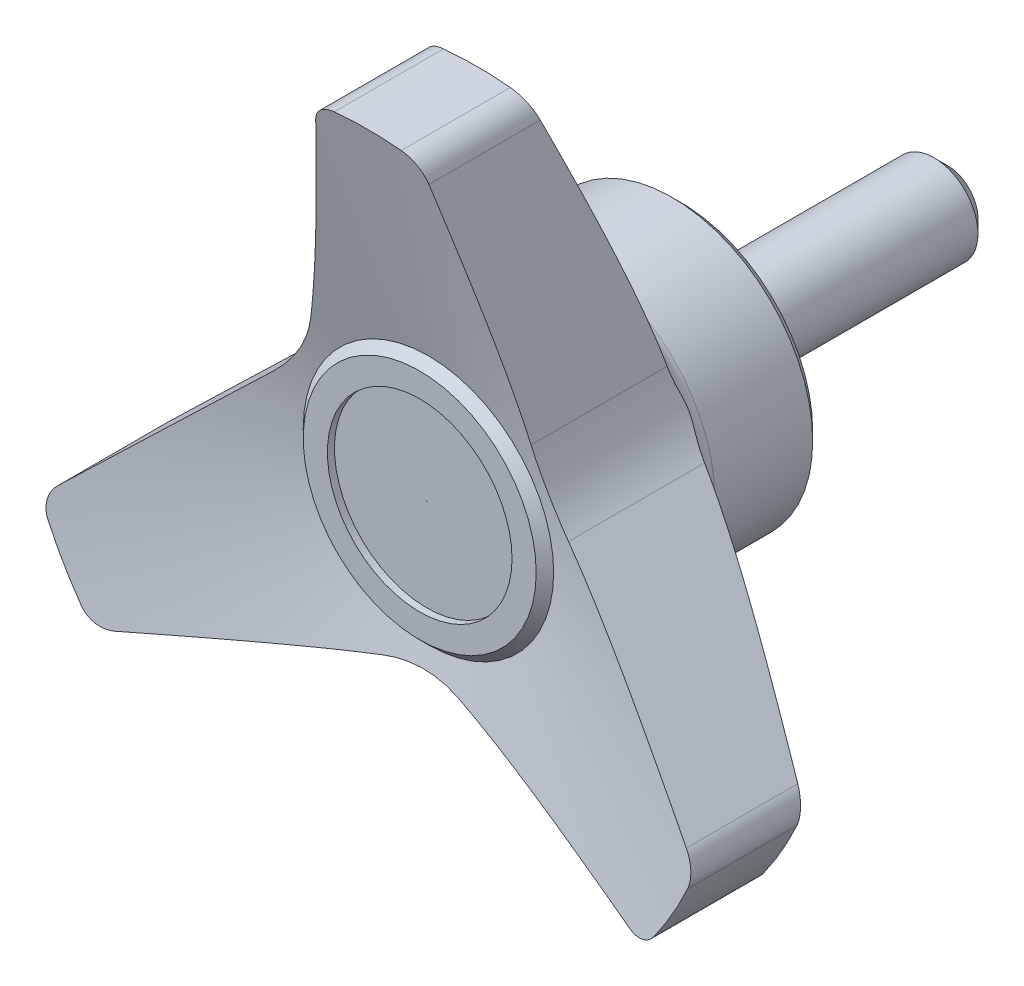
ISO-10303-21;
HEADER;
FILE_DESCRIPTION(('STEP AP214'),'2;1');
FILE_NAME('part.step','',(''),(''),'','','');
FILE_SCHEMA(('AUTOMOTIVE_DESIGN { 1 0 10303 214 1 1 1 1 }'));
ENDSEC;
DATA;
#1=APPLICATION_CONTEXT('core data for automotive mechanical design processes');
#2=APPLICATION_PROTOCOL_DEFINITION('international standard','automotive_design',2000,#1);
#3=PRODUCT_CONTEXT('',#1,'mechanical');
#4=PRODUCT('Part','Part','',(#3));
#5=PRODUCT_RELATED_PRODUCT_CATEGORY('part','',(#4));
#6=PRODUCT_DEFINITION_FORMATION('','',#4);
#7=PRODUCT_DEFINITION_CONTEXT('part definition',#1,'design');
#8=PRODUCT_DEFINITION('design','',#6,#7);
#9=PRODUCT_DEFINITION_SHAPE('','',#8);
#10=(LENGTH_UNIT() NAMED_UNIT(*) SI_UNIT(.MILLI.,.METRE.));
#11=(NAMED_UNIT(*) PLANE_ANGLE_UNIT() SI_UNIT($,.RADIAN.));
#12=(NAMED_UNIT(*) SI_UNIT($,.STERADIAN.) SOLID_ANGLE_UNIT());
#13=UNCERTAINTY_MEASURE_WITH_UNIT(LENGTH_MEASURE(1.E-05),#10,'distance_accuracy_value','');
#14=(GEOMETRIC_REPRESENTATION_CONTEXT(3) GLOBAL_UNCERTAINTY_ASSIGNED_CONTEXT((#13)) GLOBAL_UNIT_ASSIGNED_CONTEXT((#10,
#11,#12)) REPRESENTATION_CONTEXT('',''));
#15=CARTESIAN_POINT('',(0.,0.,0.));
#16=DIRECTION('',(0.,0.,1.));
#17=DIRECTION('',(1.,0.,0.));
#18=AXIS2_PLACEMENT_3D('',#15,#16,#17);
#19=CARTESIAN_POINT('',(0.,0.,12.450982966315));
#20=DIRECTION('',(0.,0.,1.));
#21=DIRECTION('',(1.,0.,0.));
#22=AXIS2_PLACEMENT_3D('',#19,#20,#21);
#23=TOROIDAL_SURFACE('',#22,18.,2.);
#24=CARTESIAN_POINT('',(0.,0.,12.450982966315));
#25=DIRECTION('',(0.,0.,1.));
#26=DIRECTION('',(1.,0.,0.));
#27=AXIS2_PLACEMENT_3D('',#24,#25,#26);
#28=CIRCLE('',#27,16.);
#29=CARTESIAN_POINT('',(16.,0.,12.450982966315));
#30=VERTEX_POINT('',#29);
#31=EDGE_CURVE('E458',#30,#30,#28,.T.);
#32=ORIENTED_EDGE('',*,*,#31,.T.);
#33=EDGE_LOOP('',(#32));
#34=FACE_BOUND('',#33,.T.);
#35=CARTESIAN_POINT('',(0.,0.,14.3053506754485));
#36=DIRECTION('',(0.,0.,1.));
#37=DIRECTION('',(1.,0.,0.));
#38=AXIS2_PLACEMENT_3D('',#35,#36,#37);
#39=CIRCLE('',#38,17.2507868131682);
#40=CARTESIAN_POINT('',(3.85877430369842,-16.813670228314,14.3053506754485));
#41=VERTEX_POINT('',#40);
#42=CARTESIAN_POINT('',(16.4904526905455,5.06503857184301,14.3053506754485));
#43=VERTEX_POINT('',#42);
#44=EDGE_CURVE('E459',#41,#43,#39,.T.);
#45=ORIENTED_EDGE('',*,*,#44,.F.);
#46=CARTESIAN_POINT('',(3.85979912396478,-16.813943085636,14.3055506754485));
#47=CARTESIAN_POINT('',(3.69635461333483,-16.7704297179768,14.2736687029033));
#48=CARTESIAN_POINT('',(3.53298553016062,-16.7298774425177,14.2378771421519));
#49=CARTESIAN_POINT('',(3.20630364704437,-16.6545624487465,14.1609660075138));
#50=CARTESIAN_POINT('',(3.04299091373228,-16.6197949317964,14.1198509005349));
#51=CARTESIAN_POINT('',(2.71190945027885,-16.5550338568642,14.0336429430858));
#52=CARTESIAN_POINT('',(2.54413275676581,-16.5251837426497,13.9884756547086));
#53=CARTESIAN_POINT('',(2.20764493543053,-16.4712039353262,13.897994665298));
#54=CARTESIAN_POINT('',(2.03893355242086,-16.4470758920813,13.852680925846));
#55=CARTESIAN_POINT('',(1.71068340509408,-16.4058457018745,13.768267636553));
#56=CARTESIAN_POINT('',(1.55124446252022,-16.3883940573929,13.7289561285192));
#57=CARTESIAN_POINT('',(1.23032773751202,-16.3585107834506,13.6570984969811));
#58=CARTESIAN_POINT('',(1.06885003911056,-16.3460789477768,13.6245520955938));
#59=CARTESIAN_POINT('',(0.746004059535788,-16.3265402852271,13.5711381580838));
#60=CARTESIAN_POINT('',(0.584669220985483,-16.3193576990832,13.5501056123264));
#61=CARTESIAN_POINT('',(0.260642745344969,-16.310227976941,13.5230312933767));
#62=CARTESIAN_POINT('',(0.0979523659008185,-16.3082764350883,13.5169769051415));
#63=CARTESIAN_POINT('',(-0.22210264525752,-16.3096541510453,13.5211544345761));
#64=CARTESIAN_POINT('',(-0.379475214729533,-16.312820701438,13.53088458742));
#65=CARTESIAN_POINT('',(-0.692700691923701,-16.3240188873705,13.5636300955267));
#66=CARTESIAN_POINT('',(-0.848552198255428,-16.3320546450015,13.5866567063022));
#67=CARTESIAN_POINT('',(-1.16041872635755,-16.3529610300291,13.6425444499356));
#68=CARTESIAN_POINT('',(-1.31640314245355,-16.3659002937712,13.6755437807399));
#69=CARTESIAN_POINT('',(-1.62653108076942,-16.3964704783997,13.7472388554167));
#70=CARTESIAN_POINT('',(-1.78067474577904,-16.4141010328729,13.7859341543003));
#71=CARTESIAN_POINT('',(-2.09789997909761,-16.4553502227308,13.8683887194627));
#72=CARTESIAN_POINT('',(-2.26089593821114,-16.4792885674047,13.9123136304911));
#73=CARTESIAN_POINT('',(-2.58608009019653,-16.5325276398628,13.9997552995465));
#74=CARTESIAN_POINT('',(-2.74826845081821,-16.5618272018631,14.0432721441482));
#75=CARTESIAN_POINT('',(-3.06864028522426,-16.6251896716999,14.1263377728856));
#76=CARTESIAN_POINT('',(-3.22683017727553,-16.6591277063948,14.165954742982));
#77=CARTESIAN_POINT('',(-3.54325791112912,-16.7324295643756,14.2401227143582));
#78=CARTESIAN_POINT('',(-3.70149570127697,-16.7717973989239,14.2746699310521));
#79=CARTESIAN_POINT('',(-3.85979905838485,-16.8139431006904,14.3055506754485));
#80=B_SPLINE_CURVE_WITH_KNOTS('',3,(#46,#47,#48,#49,#50,#51,#52,#53,#54,#55,#56,#57,#58,#59,#60,
#61,#62,#63,#64,#65,#66,#67,#68,#69,#70,#71,#72,#73,#74,#75,#76,#77,#78,#79),.UNSPECIFIED.,.F.,
.F.,(4,2,2,2,2,2,2,2,2,2,2,2,2,2,2,2,4),(0.,0.51614473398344,1.03185915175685,1.56065336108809,
2.08959985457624,2.58487225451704,3.0801243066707,3.56807937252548,4.05562332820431,
4.52797044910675,5.00071800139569,5.48034302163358,5.95993059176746,6.47134083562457,
6.9826400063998,7.48219463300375,7.98212030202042),.UNSPECIFIED.);
#81=CARTESIAN_POINT('',(-3.85877423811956,-16.8136702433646,14.3053506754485));
#82=VERTEX_POINT('',#81);
#83=EDGE_CURVE('E172',#41,#82,#80,.T.);
#84=ORIENTED_EDGE('',*,*,#83,.T.);
#85=CARTESIAN_POINT('',(-16.4904526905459,5.06503857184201,14.3053506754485));
#86=VERTEX_POINT('',#85);
#87=EDGE_CURVE('E453',#86,#82,#39,.T.);
#88=ORIENTED_EDGE('',*,*,#87,.F.);
#89=CARTESIAN_POINT('',(-16.4912014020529,5.06428748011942,14.3055506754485));
#90=CARTESIAN_POINT('',(-16.3717954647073,5.18407789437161,14.2736687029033));
#91=CARTESIAN_POINT('',(-16.254991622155,5.30528353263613,14.237877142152));
#92=CARTESIAN_POINT('',(-16.0264259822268,5.55054084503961,14.1609660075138));
#93=CARTESIAN_POINT('',(-15.9146600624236,5.67459006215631,14.1198509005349));
#94=CARTESIAN_POINT('',(-15.6930345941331,5.92893448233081,14.0336429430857));
#95=CARTESIAN_POINT('',(-15.5832952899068,6.05930830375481,13.9884756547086));
#96=CARTESIAN_POINT('',(-15.3683034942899,6.32372540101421,13.8979946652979));
#97=CARTESIAN_POINT('',(-15.2630523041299,6.45776972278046,13.8526809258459));
#98=CARTESIAN_POINT('',(-15.0632208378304,6.72142759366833,13.7682676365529));
#99=CARTESIAN_POINT('',(-14.9683877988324,6.85077994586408,13.7289561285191));
#100=CARTESIAN_POINT('',(-14.7820497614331,7.11376034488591,13.6570984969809));
#101=CARTESIAN_POINT('',(-14.6905446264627,7.24738821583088,13.6245520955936));
#102=CARTESIAN_POINT('',(-14.5122006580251,7.51721170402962,13.5711381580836));
#103=CARTESIAN_POINT('',(-14.4253129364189,7.65334047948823,13.5501056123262));
#104=CARTESIAN_POINT('',(-14.2553931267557,7.92939077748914,13.5230312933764));
#105=CARTESIAN_POINT('',(-14.1723578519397,8.06930900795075,13.516976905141));
#106=CARTESIAN_POINT('',(-14.0135234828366,8.34717363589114,13.5211544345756));
#107=CARTESIAN_POINT('',(-13.9375795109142,8.48504555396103,13.5308845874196));
#108=CARTESIAN_POINT('',(-13.790664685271,8.76190586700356,13.5636300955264));
#109=CARTESIAN_POINT('',(-13.7196981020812,8.90089510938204,13.5866567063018));
#110=CARTESIAN_POINT('',(-13.5818702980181,9.18143263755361,13.6425444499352));
#111=CARTESIAN_POINT('',(-13.515083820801,9.32298873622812,13.6755437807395));
#112=CARTESIAN_POINT('',(-13.3864944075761,9.60685250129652,13.7472388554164));
#113=CARTESIAN_POINT('',(-13.3246910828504,9.74916010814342,13.7859341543));
#114=CARTESIAN_POINT('',(-13.2018013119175,10.0445098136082,13.8683887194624));
#115=CARTESIAN_POINT('',(-13.1410345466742,10.1976376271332,13.9123136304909));
#116=CARTESIAN_POINT('',(-13.0245488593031,10.5058748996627,13.9997552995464));
#117=CARTESIAN_POINT('',(-12.9688288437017,10.6609839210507,14.0432721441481));
#118=CARTESIAN_POINT('',(-12.8635164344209,10.9701153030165,14.1263377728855));
#119=CARTESIAN_POINT('',(-12.8138126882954,11.1240807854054,14.165954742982));
#120=CARTESIAN_POINT('',(-12.7190800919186,11.4347661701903,14.2401227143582));
#121=CARTESIAN_POINT('',(-12.6740547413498,11.5914880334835,14.2746699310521));
#122=CARTESIAN_POINT('',(-12.6314023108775,11.7496556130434,14.3055506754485));
#123=B_SPLINE_CURVE_WITH_KNOTS('',3,(#89,#90,#91,#92,#93,#94,#95,#96,#97,#98,#99,#100,#101,#102,
#103,#104,#105,#106,#107,#108,#109,#110,#111,#112,#113,#114,#115,#116,#117,#118,#119,#120,#121,
#122),.UNSPECIFIED.,.F.,.F.,(4,2,2,2,2,2,2,2,2,2,2,2,2,2,2,2,4),(0.,0.516144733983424,
1.03185915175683,1.56065336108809,2.08959985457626,2.58487225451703,3.08012430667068,
3.56807937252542,4.0556233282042,4.52797044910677,5.00071800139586,5.48034302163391,
5.95993059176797,6.4713408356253,6.98264000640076,7.4821946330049,7.98212030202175),.UNSPECIFIED.);
#124=CARTESIAN_POINT('',(-12.6316784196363,11.748631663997,14.3053506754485));
#125=VERTEX_POINT('',#124);
#126=EDGE_CURVE('E423',#86,#125,#123,.T.);
#127=ORIENTED_EDGE('',*,*,#126,.T.);
#128=CARTESIAN_POINT('',(12.6316784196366,11.7486316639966,14.3053506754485));
#129=VERTEX_POINT('',#128);
#130=EDGE_CURVE('E461',#129,#125,#39,.T.);
#131=ORIENTED_EDGE('',*,*,#130,.F.);
#132=CARTESIAN_POINT('',(12.6314023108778,11.7496556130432,14.3055506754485));
#133=CARTESIAN_POINT('',(12.6754408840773,11.5863518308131,14.2736687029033));
#134=CARTESIAN_POINT('',(12.7220061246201,11.4245939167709,14.237877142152));
#135=CARTESIAN_POINT('',(12.8201223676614,11.1040216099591,14.1609660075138));
#136=CARTESIAN_POINT('',(12.8716691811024,10.9452048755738,14.1198509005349));
#137=CARTESIAN_POINT('',(12.9811251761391,10.6260993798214,14.0336429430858));
#138=CARTESIAN_POINT('',(13.0391625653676,10.4658754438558,13.9884756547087));
#139=CARTESIAN_POINT('',(13.1606585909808,10.1474785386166,13.8979946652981));
#140=CARTESIAN_POINT('',(13.2241187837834,9.98930617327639,13.8526809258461));
#141=CARTESIAN_POINT('',(13.3525374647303,9.68441811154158,13.7682676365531));
#142=CARTESIAN_POINT('',(13.4171433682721,9.53761411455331,13.7289561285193));
#143=CARTESIAN_POINT('',(13.5517220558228,9.24475044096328,13.6570984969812));
#144=CARTESIAN_POINT('',(13.6216946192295,9.09869073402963,13.6245520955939));
#145=CARTESIAN_POINT('',(13.7661966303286,8.80932858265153,13.571138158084));
#146=CARTESIAN_POINT('',(13.8406437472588,8.66601722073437,13.5501056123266));
#147=CARTESIAN_POINT('',(13.9947504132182,8.38083719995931,13.5230312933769));
#148=CARTESIAN_POINT('',(14.0744055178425,8.23896742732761,13.5169769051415));
#149=CARTESIAN_POINT('',(14.2356261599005,7.96248051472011,13.5211544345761));
#150=CARTESIAN_POINT('',(14.3170547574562,7.82777514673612,13.5308845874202));
#151=CARTESIAN_POINT('',(14.4833654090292,7.56211301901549,13.563630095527));
#152=CARTESIAN_POINT('',(14.5682503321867,7.4311595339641,13.5866567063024));
#153=CARTESIAN_POINT('',(14.7422890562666,7.17152839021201,13.6425444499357));
#154=CARTESIAN_POINT('',(14.8314869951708,7.04291155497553,13.67554378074));
#155=CARTESIAN_POINT('',(15.0130255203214,6.78961797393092,13.7472388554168));
#156=CARTESIAN_POINT('',(15.1053658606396,6.66494092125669,13.7859341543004));
#157=CARTESIAN_POINT('',(15.2997013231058,6.41084040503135,13.8683887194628));
#158=CARTESIAN_POINT('',(15.4019305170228,6.28165093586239,13.9123136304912));
#159=CARTESIAN_POINT('',(15.6106289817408,6.02665273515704,13.9997552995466));
#160=CARTESIAN_POINT('',(15.7170973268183,5.90084327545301,14.0432721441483));
#161=CARTESIAN_POINT('',(15.9321567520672,5.65507436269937,14.1263377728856));
#162=CARTESIAN_POINT('',(16.0406428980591,5.53504691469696,14.165954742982));
#163=CARTESIAN_POINT('',(16.2623380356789,5.29766338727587,14.2401227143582));
#164=CARTESIAN_POINT('',(16.3755504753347,5.18030935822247,14.2746699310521));
#165=CARTESIAN_POINT('',(16.4912014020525,5.06428748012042,14.3055506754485));
#166=B_SPLINE_CURVE_WITH_KNOTS('',3,(#132,#133,#134,#135,#136,#137,#138,#139,#140,#141,#142,
#143,#144,#145,#146,#147,#148,#149,#150,#151,#152,#153,#154,#155,#156,#157,#158,#159,#160,#161,
#162,#163,#164,#165),.UNSPECIFIED.,.F.,.F.,(4,2,2,2,2,2,2,2,2,2,2,2,2,2,2,2,4),(0.,
0.516144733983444,1.03185915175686,1.56065336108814,2.08959985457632,2.58487225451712,
3.0801243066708,3.56807937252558,4.05562332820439,4.52797044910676,5.00071800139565,
5.48034302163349,5.95993059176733,6.47134083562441,6.98264000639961,7.48219463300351,
7.98212030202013),.UNSPECIFIED.);
#167=EDGE_CURVE('E399',#129,#43,#166,.T.);
#168=ORIENTED_EDGE('',*,*,#167,.T.);
#169=EDGE_LOOP('',(#45,#84,#88,#127,#131,#168));
#170=FACE_BOUND('',#169,.T.);
#171=ADVANCED_FACE('F14',(#34,#170),#23,.F.);
#172=CARTESIAN_POINT('',(0.,0.,14.3053506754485));
#173=DIRECTION('',(0.,0.,1.));
#174=DIRECTION('',(1.,0.,0.));
#175=AXIS2_PLACEMENT_3D('',#172,#173,#174);
#176=CONICAL_SURFACE('',#175,17.2507868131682,1.18682389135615);
#177=CARTESIAN_POINT('',(-29.286687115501,-24.3397153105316,22.721139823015));
#178=CARTESIAN_POINT('',(-28.7732164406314,-24.187618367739,22.5223177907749));
#179=CARTESIAN_POINT('',(-28.2595260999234,-24.0354563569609,22.3241131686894));
#180=CARTESIAN_POINT('',(-27.2316450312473,-23.7309841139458,21.9291153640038));
#181=CARTESIAN_POINT('',(-26.7174543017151,-23.5786738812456,21.7323221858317));
#182=CARTESIAN_POINT('',(-25.174082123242,-23.1215062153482,21.1443408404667));
#183=CARTESIAN_POINT('',(-24.1440634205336,-22.816400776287,20.7555364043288));
#184=CARTESIAN_POINT('',(-22.0823316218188,-22.2056879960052,19.9866452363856));
#185=CARTESIAN_POINT('',(-21.0506216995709,-21.9000815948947,19.6065492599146));
#186=CARTESIAN_POINT('',(-18.9834484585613,-21.287756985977,18.8573182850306));
#187=CARTESIAN_POINT('',(-17.947984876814,-20.98103870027,18.4881840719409));
#188=CARTESIAN_POINT('',(-16.3905297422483,-20.5196994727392,17.9455224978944));
#189=CARTESIAN_POINT('',(-15.8703409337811,-20.3656125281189,17.7663665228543));
#190=CARTESIAN_POINT('',(-14.8285715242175,-20.0570263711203,17.4125102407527));
#191=CARTESIAN_POINT('',(-14.3069909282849,-19.9025271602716,17.2378099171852));
#192=CARTESIAN_POINT('',(-13.2623215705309,-19.5930819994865,16.893705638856));
#193=CARTESIAN_POINT('',(-12.7392330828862,-19.4381361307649,16.7243007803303));
#194=CARTESIAN_POINT('',(-11.6912288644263,-19.1277031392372,16.3917587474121));
#195=CARTESIAN_POINT('',(-11.1663131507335,-18.9722160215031,16.2286215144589));
#196=CARTESIAN_POINT('',(-10.1137566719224,-18.6604345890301,15.9096437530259));
#197=CARTESIAN_POINT('',(-9.58611339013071,-18.5041395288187,15.7538122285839));
#198=CARTESIAN_POINT('',(-8.52847732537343,-18.1908534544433,15.45116064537));
#199=CARTESIAN_POINT('',(-7.99848466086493,-18.033862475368,15.3043401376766));
#200=CARTESIAN_POINT('',(-6.93550471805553,-17.718993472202,15.0214201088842));
#201=CARTESIAN_POINT('',(-6.40251578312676,-17.5611149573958,14.8853273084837));
#202=CARTESIAN_POINT('',(-5.60081785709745,-17.3236412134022,14.6909198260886));
#203=CARTESIAN_POINT('',(-5.33319204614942,-17.2443668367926,14.6277340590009));
#204=CARTESIAN_POINT('',(-4.79718332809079,-17.0855938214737,14.5049172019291));
#205=CARTESIAN_POINT('',(-4.5288003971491,-17.0060951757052,14.445286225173));
#206=CARTESIAN_POINT('',(-4.2600301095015,-16.9264817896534,14.387587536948));
#207=B_SPLINE_CURVE_WITH_KNOTS('',3,(#177,#178,#179,#180,#181,#182,#183,#184,#185,#186,#187,
#188,#189,#190,#191,#192,#193,#194,#195,#196,#197,#198,#199,#200,#201,#202,#203,#204,#205,#206),
.UNSPECIFIED.,.F.,.F.,(4,2,2,2,2,2,2,2,2,2,2,2,2,2,4),(0.,1.7137208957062,3.42744716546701,
6.85477530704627,10.2782785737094,13.7020265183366,15.4160488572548,17.1300648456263,
18.8437866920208,20.5574925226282,22.2732577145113,23.988937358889,25.7056834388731,
26.5642103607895,27.422764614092),.UNSPECIFIED.);
#208=CARTESIAN_POINT('',(-29.286487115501,-24.3396560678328,22.721062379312));
#209=VERTEX_POINT('',#208);
#210=CARTESIAN_POINT('',(-4.26023010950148,-16.926541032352,14.3876304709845));
#211=VERTEX_POINT('',#210);
#212=EDGE_CURVE('E348',#209,#211,#207,.T.);
#213=ORIENTED_EDGE('',*,*,#212,.F.);
#214=CARTESIAN_POINT('',(-29.286287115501,-24.3395968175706,22.720984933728));
#215=CARTESIAN_POINT('',(-29.3678871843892,-24.3637708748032,22.7525832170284));
#216=CARTESIAN_POINT('',(-29.450657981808,-24.3845185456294,22.7836773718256));
#217=CARTESIAN_POINT('',(-29.6181046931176,-24.4189494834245,22.844692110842));
#218=CARTESIAN_POINT('',(-29.702781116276,-24.4326308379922,22.8746123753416));
#219=CARTESIAN_POINT('',(-29.9591962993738,-24.4627702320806,22.9624244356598));
#220=CARTESIAN_POINT('',(-30.1330795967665,-24.468251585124,23.018274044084));
#221=CARTESIAN_POINT('',(-30.4816078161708,-24.4486356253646,23.1228787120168));
#222=CARTESIAN_POINT('',(-30.6562535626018,-24.4234784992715,23.1716196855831));
#223=CARTESIAN_POINT('',(-31.0003448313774,-24.3421695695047,23.2602802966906));
#224=CARTESIAN_POINT('',(-31.1697962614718,-24.2860544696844,23.3002103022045));
#225=CARTESIAN_POINT('',(-31.4894131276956,-24.1471971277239,23.3680836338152));
#226=CARTESIAN_POINT('',(-31.6401221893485,-24.0659719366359,23.3965376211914));
#227=CARTESIAN_POINT('',(-31.854795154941,-23.9252694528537,23.4315509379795));
#228=CARTESIAN_POINT('',(-31.9244667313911,-23.8752130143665,23.4419453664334));
#229=CARTESIAN_POINT('',(-32.0594695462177,-23.76913736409,23.4600976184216));
#230=CARTESIAN_POINT('',(-32.124802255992,-23.7131201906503,23.467856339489));
#231=CARTESIAN_POINT('',(-32.2606690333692,-23.5860526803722,23.4816888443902));
#232=CARTESIAN_POINT('',(-32.3303482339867,-23.5140337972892,23.487290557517));
#233=CARTESIAN_POINT('',(-32.4621656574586,-23.3634019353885,23.494764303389));
#234=CARTESIAN_POINT('',(-32.5243143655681,-23.2847983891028,23.4966415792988));
#235=CARTESIAN_POINT('',(-32.5823404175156,-23.2032560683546,23.4966294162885));
#236=B_SPLINE_CURVE_WITH_KNOTS('',3,(#214,#215,#216,#217,#218,#219,#220,#221,#222,#223,#224,
#225,#226,#227,#228,#229,#230,#231,#232,#233,#234,#235),.UNSPECIFIED.,.F.,.F.,(4,2,2,2,2,2,2,2,
2,2,4),(0.,0.272197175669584,0.544467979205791,1.08980582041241,1.63620999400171,
2.18196773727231,2.69967080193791,2.95862241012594,3.21748574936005,3.51800640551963,
3.81810369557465),.UNSPECIFIED.);
#237=CARTESIAN_POINT('',(-32.5821979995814,-23.2034560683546,23.4966294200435));
#238=VERTEX_POINT('',#237);
#239=EDGE_CURVE('E340',#209,#238,#236,.T.);
#240=ORIENTED_EDGE('',*,*,#239,.T.);
#241=CARTESIAN_POINT('',(0.,0.,23.4966294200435));
#242=DIRECTION('',(0.,0.,1.));
#243=DIRECTION('',(1.,0.,0.));
#244=AXIS2_PLACEMENT_3D('',#241,#242,#243);
#245=CIRCLE('',#244,40.);
#246=CARTESIAN_POINT('',(-36.3858814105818,-16.615283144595,23.4966294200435));
#247=VERTEX_POINT('',#246);
#248=EDGE_CURVE('E466',#247,#238,#245,.T.);
#249=ORIENTED_EDGE('',*,*,#248,.F.);
#250=CARTESIAN_POINT('',(-36.3857900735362,-16.615483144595,23.4966294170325));
#251=CARTESIAN_POINT('',(-36.4192196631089,-16.5423153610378,23.4966350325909));
#252=CARTESIAN_POINT('',(-36.4496847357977,-16.4677994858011,23.495424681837));
#253=CARTESIAN_POINT('',(-36.5045136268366,-16.3166453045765,23.4905984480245));
#254=CARTESIAN_POINT('',(-36.5288784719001,-16.2400073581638,23.4869829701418));
#255=CARTESIAN_POINT('',(-36.5713012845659,-16.0853210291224,23.4773829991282));
#256=CARTESIAN_POINT('',(-36.5893724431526,-16.0072759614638,23.4714035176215));
#257=CARTESIAN_POINT('',(-36.6191962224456,-15.8502175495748,23.4571322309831));
#258=CARTESIAN_POINT('',(-36.6309487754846,-15.771204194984,23.4488404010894));
#259=CARTESIAN_POINT('',(-36.6566521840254,-15.5335833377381,23.420590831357));
#260=CARTESIAN_POINT('',(-36.6610926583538,-15.3742337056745,23.3972489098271));
#261=CARTESIAN_POINT('',(-36.6449964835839,-15.0583655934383,23.342310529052));
#262=CARTESIAN_POINT('',(-36.6244586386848,-14.9018472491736,23.3107136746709));
#263=CARTESIAN_POINT('',(-36.5588854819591,-14.5916724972,23.2392929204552));
#264=CARTESIAN_POINT('',(-36.5132486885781,-14.4381863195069,23.1992825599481));
#265=CARTESIAN_POINT('',(-36.3990495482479,-14.1419123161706,23.1126401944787));
#266=CARTESIAN_POINT('',(-36.3304697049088,-13.9991327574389,23.0660031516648));
#267=CARTESIAN_POINT('',(-36.1791460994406,-13.7383917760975,22.9712688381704));
#268=CARTESIAN_POINT('',(-36.0979841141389,-13.6193579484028,22.9235903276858));
#269=CARTESIAN_POINT('',(-35.9649538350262,-13.4512790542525,22.849416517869));
#270=CARTESIAN_POINT('',(-35.9187699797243,-13.3970366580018,22.8242700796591));
#271=CARTESIAN_POINT('',(-35.8228738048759,-13.2921739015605,22.7731847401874));
#272=CARTESIAN_POINT('',(-35.7731618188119,-13.2415531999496,22.7472459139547));
#273=CARTESIAN_POINT('',(-35.7218040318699,-13.1928240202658,22.720960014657));
#274=B_SPLINE_CURVE_WITH_KNOTS('',3,(#250,#251,#252,#253,#254,#255,#256,#257,#258,#259,#260,
#261,#262,#263,#264,#265,#266,#267,#268,#269,#270,#271,#272,#273),.UNSPECIFIED.,.F.,.F.,(4,2,2,
2,2,2,2,2,2,2,2,4),(0.,0.241244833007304,0.482449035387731,0.723144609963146,0.963842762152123,
1.44474291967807,1.9256661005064,2.41865090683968,2.91201252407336,3.36571400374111,
3.5922084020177,3.81868142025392),.UNSPECIFIED.);
#275=CARTESIAN_POINT('',(-35.7220040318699,-13.1930137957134,22.7210623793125));
#276=VERTEX_POINT('',#275);
#277=EDGE_CURVE('E554',#247,#276,#274,.T.);
#278=ORIENTED_EDGE('',*,*,#277,.T.);
#279=CARTESIAN_POINT('',(-35.7222040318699,-13.1932035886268,22.7211647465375));
#280=CARTESIAN_POINT('',(-35.333746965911,-12.8245715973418,22.5223416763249));
#281=CARTESIAN_POINT('',(-34.9451237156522,-12.4557819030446,22.3241360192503));
#282=CARTESIAN_POINT('',(-34.1674986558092,-11.7178432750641,21.9291361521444));
#283=CARTESIAN_POINT('',(-33.7784968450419,-11.3486943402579,21.7323419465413));
#284=CARTESIAN_POINT('',(-32.6108861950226,-10.2406732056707,21.1443575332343));
#285=CARTESIAN_POINT('',(-31.8316439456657,-9.5011999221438,20.7555510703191));
#286=CARTESIAN_POINT('',(-30.271877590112,-8.02103691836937,19.9866559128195));
#287=CARTESIAN_POINT('',(-29.4913558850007,-7.28034947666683,19.6065579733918));
#288=CARTESIAN_POINT('',(-27.9274728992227,-5.79627993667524,18.8573231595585));
#289=CARTESIAN_POINT('',(-27.1441114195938,-5.05289764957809,18.4881870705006));
#290=CARTESIAN_POINT('',(-25.9658465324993,-3.93476602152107,17.945522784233));
#291=CARTESIAN_POINT('',(-25.5723069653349,-3.5613109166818,17.7663659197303));
#292=CARTESIAN_POINT('',(-24.7841748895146,-2.81340150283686,17.4125079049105));
#293=CARTESIAN_POINT('',(-24.3895823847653,-2.43894719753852,17.2378067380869));
#294=CARTESIAN_POINT('',(-23.5992563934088,-1.68895583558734,16.89370083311));
#295=CARTESIAN_POINT('',(-23.2035231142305,-1.31341897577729,16.7242951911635));
#296=CARTESIAN_POINT('',(-22.410674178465,-0.561033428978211,16.3917516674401));
#297=CARTESIAN_POINT('',(-22.0135585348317,-0.184184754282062,16.2286137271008));
#298=CARTESIAN_POINT('',(-21.2172656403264,0.57146898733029,15.9096346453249));
#299=CARTESIAN_POINT('',(-20.8180864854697,0.950275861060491,15.7538025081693));
#300=CARTESIAN_POINT('',(-20.0179506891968,1.70957638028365,15.451149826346));
#301=CARTESIAN_POINT('',(-19.6169941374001,2.09006994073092,15.3043288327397));
#302=CARTESIAN_POINT('',(-18.8128154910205,2.85320698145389,15.0214079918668));
#303=CARTESIAN_POINT('',(-18.4095921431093,3.23585165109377,14.8853148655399));
#304=CARTESIAN_POINT('',(-17.8030817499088,3.81140852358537,14.6909070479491));
#305=CARTESIAN_POINT('',(-17.6006141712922,4.00354308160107,14.6277211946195));
#306=CARTESIAN_POINT('',(-17.1951062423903,4.38835573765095,14.5049042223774));
#307=CARTESIAN_POINT('',(-16.9920658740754,4.58103385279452,14.4452732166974));
#308=CARTESIAN_POINT('',(-16.7887324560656,4.773990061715,14.3875745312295));
#309=B_SPLINE_CURVE_WITH_KNOTS('',3,(#279,#280,#281,#282,#283,#284,#285,#286,#287,#288,#289,
#290,#291,#292,#293,#294,#295,#296,#297,#298,#299,#300,#301,#302,#303,#304,#305,#306,#307,#308),
.UNSPECIFIED.,.F.,.F.,(4,2,2,2,2,2,2,2,2,2,2,2,2,2,4),(0.,1.71372939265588,3.42746415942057,
6.8548092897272,10.2783294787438,13.702094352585,15.4161252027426,17.1301497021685,
18.8438800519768,20.5575943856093,22.2733681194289,23.9890563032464,25.7058109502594,
26.5643421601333,27.4229007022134),.UNSPECIFIED.);
#310=CARTESIAN_POINT('',(-16.7889324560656,4.77380026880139,14.3876312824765));
#311=VERTEX_POINT('',#310);
#312=EDGE_CURVE('E562',#276,#311,#309,.T.);
#313=ORIENTED_EDGE('',*,*,#312,.T.);
#314=CARTESIAN_POINT('',(-17.9219875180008,3.801050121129,14.7375968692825));
#315=CARTESIAN_POINT('',(-17.6443007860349,4.01635891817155,14.6458944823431));
#316=CARTESIAN_POINT('',(-17.3729267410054,4.24247013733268,14.5599678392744));
#317=CARTESIAN_POINT('',(-16.844440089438,4.71564682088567,14.4018241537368));
#318=CARTESIAN_POINT('',(-16.5873397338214,4.96272983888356,14.3296187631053));
#319=CARTESIAN_POINT('',(-16.0903956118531,5.47592046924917,14.2014660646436));
#320=CARTESIAN_POINT('',(-15.8504938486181,5.74195746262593,14.1454619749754));
#321=CARTESIAN_POINT('',(-15.3890221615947,6.29236855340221,14.0514225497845));
#322=CARTESIAN_POINT('',(-15.1674466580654,6.57673702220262,14.0133817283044));
#323=CARTESIAN_POINT('',(-14.7436252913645,7.16329628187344,13.9566920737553));
#324=CARTESIAN_POINT('',(-14.5414674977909,7.46555906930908,13.9381281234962));
#325=CARTESIAN_POINT('',(-14.1594203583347,8.08443295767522,13.9215231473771));
#326=CARTESIAN_POINT('',(-13.9795331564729,8.40104543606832,13.9234840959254));
#327=CARTESIAN_POINT('',(-13.6434539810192,9.04608640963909,13.9478499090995));
#328=CARTESIAN_POINT('',(-13.4872769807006,9.37452221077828,13.9702676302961));
#329=CARTESIAN_POINT('',(-13.1997962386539,10.0401985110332,14.0345620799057));
#330=CARTESIAN_POINT('',(-13.0684904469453,10.3774382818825,14.0764372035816));
#331=CARTESIAN_POINT('',(-12.8399689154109,11.0331066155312,14.1742073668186));
#332=CARTESIAN_POINT('',(-12.7409597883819,11.3511019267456,14.2288496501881));
#333=CARTESIAN_POINT('',(-12.5648157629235,11.9905390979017,14.3516994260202));
#334=CARTESIAN_POINT('',(-12.4876838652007,12.3119814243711,14.4199087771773));
#335=CARTESIAN_POINT('',(-12.3552067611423,12.9564775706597,14.5680638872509));
#336=CARTESIAN_POINT('',(-12.2998537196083,13.2795307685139,14.6480054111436));
#337=CARTESIAN_POINT('',(-12.2106169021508,13.9257788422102,14.8178655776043));
#338=CARTESIAN_POINT('',(-12.1767201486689,14.2489735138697,14.9077781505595));
#339=CARTESIAN_POINT('',(-12.1533793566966,14.5716434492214,15.0018374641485));
#340=B_SPLINE_CURVE_WITH_KNOTS('',3,(#314,#315,#316,#317,#318,#319,#320,#321,#322,#323,#324,
#325,#326,#327,#328,#329,#330,#331,#332,#333,#334,#335,#336,#337,#338,#339),.UNSPECIFIED.,.F.,
.F.,(4,2,2,2,2,2,2,2,2,2,2,2,4),(0.,1.08936675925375,2.17965449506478,3.26607339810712,
4.35216029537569,5.44296108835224,6.53386681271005,7.62545861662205,8.71696040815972,
9.7284493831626,10.7400770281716,11.7513403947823,12.7619915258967),.UNSPECIFIED.);
#341=EDGE_CURVE('E455',#86,#311,#340,.F.);
#342=ORIENTED_EDGE('',*,*,#341,.F.);
#343=ORIENTED_EDGE('',*,*,#87,.T.);
#344=CARTESIAN_POINT('',(-4.26043010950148,-16.9266002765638,14.3876734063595));
#345=CARTESIAN_POINT('',(-4.1936896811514,-16.9068282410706,14.3733408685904));
#346=CARTESIAN_POINT('',(-4.12676275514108,-16.8875086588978,14.3592977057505));
#347=CARTESIAN_POINT('',(-3.99253590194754,-16.8497743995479,14.3317901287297));
#348=CARTESIAN_POINT('',(-3.92523597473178,-16.8313597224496,14.3183257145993));
#349=CARTESIAN_POINT('',(-3.85774954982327,-16.8133974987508,14.3051506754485));
#350=B_SPLINE_CURVE_WITH_KNOTS('',3,(#344,#345,#346,#347,#348,#349),.UNSPECIFIED.,.F.,.F.,(4,2,
4),(0.,0.213183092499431,0.426366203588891),.UNSPECIFIED.);
#351=EDGE_CURVE('E434',#211,#82,#350,.T.);
#352=ORIENTED_EDGE('',*,*,#351,.F.);
#353=EDGE_LOOP('',(#213,#240,#249,#278,#313,#342,#343,#352));
#354=FACE_BOUND('',#353,.T.);
#355=ADVANCED_FACE('F416',(#354),#176,.T.);
#356=CARTESIAN_POINT('',(0.,0.,35.2));
#357=DIRECTION('',(0.,0.,1.));
#358=DIRECTION('',(1.,0.,0.));
#359=AXIS2_PLACEMENT_3D('',#356,#357,#358);
#360=CYLINDRICAL_SURFACE('',#359,40.);
#361=ORIENTED_EDGE('',*,*,#248,.T.);
#362=DIRECTION('',(0.,0.,1.));
#363=VECTOR('',#362,1.);
#364=CARTESIAN_POINT('',(-32.5821979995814,-23.2034560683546,10.));
#365=LINE('',#364,#363);
#366=CARTESIAN_POINT('',(-32.5821979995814,-23.2034560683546,35.9096761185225));
#367=VERTEX_POINT('',#366);
#368=EDGE_CURVE('E877',#238,#367,#365,.T.);
#369=ORIENTED_EDGE('',*,*,#368,.T.);
#370=CARTESIAN_POINT('',(0.,0.,35.9096761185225));
#371=DIRECTION('',(0.,0.,1.));
#372=DIRECTION('',(1.,0.,0.));
#373=AXIS2_PLACEMENT_3D('',#370,#371,#372);
#374=CIRCLE('',#373,40.);
#375=CARTESIAN_POINT('',(-36.3858814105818,-16.615283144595,35.9096761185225));
#376=VERTEX_POINT('',#375);
#377=EDGE_CURVE('E480',#376,#367,#374,.T.);
#378=ORIENTED_EDGE('',*,*,#377,.F.);
#379=DIRECTION('',(0.,0.,1.));
#380=VECTOR('',#379,1.);
#381=CARTESIAN_POINT('',(-36.3858814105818,-16.615283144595,10.));
#382=LINE('',#381,#380);
#383=EDGE_CURVE('E900',#247,#376,#382,.T.);
#384=ORIENTED_EDGE('',*,*,#383,.F.);
#385=EDGE_LOOP('',(#361,#369,#378,#384));
#386=FACE_BOUND('',#385,.T.);
#387=ADVANCED_FACE('F682',(#386),#360,.T.);
#388=CARTESIAN_POINT('',(32.5821979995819,-23.2034560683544,23.4966294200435));
#389=VERTEX_POINT('',#388);
#390=CARTESIAN_POINT('',(36.3858814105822,-16.615283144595,23.4966294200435));
#391=VERTEX_POINT('',#390);
#392=EDGE_CURVE('E473',#389,#391,#245,.T.);
#393=ORIENTED_EDGE('',*,*,#392,.F.);
#394=CARTESIAN_POINT('',(32.582340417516,-23.2032560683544,23.496629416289));
#395=CARTESIAN_POINT('',(32.5356906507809,-23.2687911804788,23.4966352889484));
#396=CARTESIAN_POINT('',(32.4863911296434,-23.3324330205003,23.4954251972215));
#397=CARTESIAN_POINT('',(32.3829033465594,-23.4554941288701,23.4905994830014));
#398=CARTESIAN_POINT('',(32.3287159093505,-23.5149141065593,23.4869842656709));
#399=CARTESIAN_POINT('',(32.2159660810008,-23.628997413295,23.4773848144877));
#400=CARTESIAN_POINT('',(32.1574131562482,-23.6836705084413,23.4714055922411));
#401=CARTESIAN_POINT('',(32.0363094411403,-23.788028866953,23.457134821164));
#402=CARTESIAN_POINT('',(31.9737586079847,-23.8377140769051,23.4488432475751));
#403=CARTESIAN_POINT('',(31.7808259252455,-23.9787859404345,23.4205944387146));
#404=CARTESIAN_POINT('',(31.6450461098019,-24.0623074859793,23.3972530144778));
#405=CARTESIAN_POINT('',(31.3634495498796,-24.2063042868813,23.3423155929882));
#406=CARTESIAN_POINT('',(31.2176323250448,-24.2667784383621,23.3107192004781));
#407=CARTESIAN_POINT('',(30.9162275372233,-24.3650804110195,23.2392993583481));
#408=CARTESIAN_POINT('',(30.7604866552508,-24.4023022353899,23.1992894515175));
#409=CARTESIAN_POINT('',(30.4468069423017,-24.4515426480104,23.1126479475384));
#410=CARTESIAN_POINT('',(30.2888665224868,-24.4635419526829,23.0660113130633));
#411=CARTESIAN_POINT('',(29.9874032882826,-24.4628651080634,22.9712798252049));
#412=CARTESIAN_POINT('',(29.8437425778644,-24.4520959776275,22.9236039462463));
#413=CARTESIAN_POINT('',(29.631676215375,-24.4209326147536,22.8494342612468));
#414=CARTESIAN_POINT('',(29.5616120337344,-24.408059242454,22.8242892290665));
#415=CARTESIAN_POINT('',(29.4228559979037,-24.3774461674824,22.7732067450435));
#416=CARTESIAN_POINT('',(29.3541640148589,-24.3597069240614,22.7472693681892));
#417=CARTESIAN_POINT('',(29.2862871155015,-24.3395968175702,22.720984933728));
#418=B_SPLINE_CURVE_WITH_KNOTS('',3,(#394,#395,#396,#397,#398,#399,#400,#401,#402,#403,#404,
#405,#406,#407,#408,#409,#410,#411,#412,#413,#414,#415,#416,#417),.UNSPECIFIED.,.F.,.F.,(4,2,2,
2,2,2,2,2,2,2,2,4),(0.,0.241244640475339,0.482448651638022,0.723144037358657,0.963842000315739,
1.44474179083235,1.92566461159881,2.41864875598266,2.91200966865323,3.3656896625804,
3.59217328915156,3.81863554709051),.UNSPECIFIED.);
#419=CARTESIAN_POINT('',(29.2864871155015,-24.3396560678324,22.7210623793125));
#420=VERTEX_POINT('',#419);
#421=EDGE_CURVE('E186',#389,#420,#418,.T.);
#422=ORIENTED_EDGE('',*,*,#421,.T.);
#423=CARTESIAN_POINT('',(29.2866871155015,-24.3397153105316,22.721139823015));
#424=CARTESIAN_POINT('',(28.7732164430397,-24.1876183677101,22.5223177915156));
#425=CARTESIAN_POINT('',(28.2595261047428,-24.0354563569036,22.3241131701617));
#426=CARTESIAN_POINT('',(27.2316450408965,-23.7309841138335,21.9291153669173));
#427=CARTESIAN_POINT('',(26.717454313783,-23.5786738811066,21.7323221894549));
#428=CARTESIAN_POINT('',(25.1740821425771,-23.1215062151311,21.1443408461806));
#429=CARTESIAN_POINT('',(24.1440634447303,-22.8164007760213,20.7555364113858));
#430=CARTESIAN_POINT('',(22.0823316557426,-22.2056879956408,19.9866452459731));
#431=CARTESIAN_POINT('',(21.0506217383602,-21.9000815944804,19.6065492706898));
#432=CARTESIAN_POINT('',(18.9834485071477,-21.287756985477,18.8573182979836));
#433=CARTESIAN_POINT('',(17.9479849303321,-20.9810386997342,18.4881840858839));
#434=CARTESIAN_POINT('',(16.3905298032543,-20.5196994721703,17.9455225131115));
#435=CARTESIAN_POINT('',(15.8703409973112,-20.3656125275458,17.766366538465));
#436=CARTESIAN_POINT('',(14.828571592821,-20.0570263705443,17.4125102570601));
#437=CARTESIAN_POINT('',(14.3069909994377,-19.902527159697,17.2378099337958));
#438=CARTESIAN_POINT('',(13.262321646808,-19.5930819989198,16.8937056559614));
#439=CARTESIAN_POINT('',(12.7392331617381,-19.4381361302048,16.7243007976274));
#440=CARTESIAN_POINT('',(11.691228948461,-19.1277031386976,16.3917587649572));
#441=CARTESIAN_POINT('',(11.1663132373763,-18.9722160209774,16.2286215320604));
#442=CARTESIAN_POINT('',(10.1137567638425,-18.6604345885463,15.9096437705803));
#443=CARTESIAN_POINT('',(9.58611348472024,-18.5041395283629,15.7538122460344));
#444=CARTESIAN_POINT('',(8.52847742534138,-18.1908534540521,15.4511606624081));
#445=CARTESIAN_POINT('',(7.99848476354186,-18.0338624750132,15.3043401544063));
#446=CARTESIAN_POINT('',(6.93550482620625,-17.7189934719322,15.0214201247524));
#447=CARTESIAN_POINT('',(6.40251589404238,-17.5611149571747,14.8853273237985));
#448=CARTESIAN_POINT('',(5.6008179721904,-17.3236412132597,14.6909198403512));
#449=CARTESIAN_POINT('',(5.33319216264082,-17.2443668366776,14.6277340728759));
#450=CARTESIAN_POINT('',(4.79718344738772,-17.085593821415,14.5049172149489));
#451=CARTESIAN_POINT('',(4.52880051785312,-17.0060951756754,14.4452862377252));
#452=CARTESIAN_POINT('',(4.26003023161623,-16.926481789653,14.3875875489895));
#453=B_SPLINE_CURVE_WITH_KNOTS('',3,(#423,#424,#425,#426,#427,#428,#429,#430,#431,#432,#433,
#434,#435,#436,#437,#438,#439,#440,#441,#442,#443,#444,#445,#446,#447,#448,#449,#450,#451,#452),
.UNSPECIFIED.,.F.,.F.,(4,2,2,2,2,2,2,2,2,2,2,2,2,2,4),(0.,1.71372088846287,3.42744715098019,
6.85477527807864,10.2782785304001,13.7020264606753,15.416048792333,17.1300647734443,
18.8437866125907,20.5574924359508,22.2732576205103,23.9889372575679,25.7056833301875,
26.5642102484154,27.4227644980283),.UNSPECIFIED.);
#454=CARTESIAN_POINT('',(4.26023023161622,-16.926541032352,14.3876304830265));
#455=VERTEX_POINT('',#454);
#456=EDGE_CURVE('E176',#420,#455,#453,.T.);
#457=ORIENTED_EDGE('',*,*,#456,.T.);
#458=CARTESIAN_POINT('',(3.85774961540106,-16.8133974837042,14.3051506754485));
#459=CARTESIAN_POINT('',(3.92523604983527,-16.8313597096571,14.3183257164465));
#460=CARTESIAN_POINT('',(3.99253598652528,-16.8497743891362,14.3317901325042));
#461=CARTESIAN_POINT('',(4.12676285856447,-16.8875086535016,14.3592977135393));
#462=CARTESIAN_POINT('',(4.19368979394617,-16.9068282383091,14.3733408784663));
#463=CARTESIAN_POINT('',(4.26043023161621,-16.9266002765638,14.3876734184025));
#464=B_SPLINE_CURVE_WITH_KNOTS('',3,(#458,#459,#460,#461,#462,#463),.UNSPECIFIED.,.F.,.F.,(4,2,
4),(0.,0.213183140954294,0.426366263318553),.UNSPECIFIED.);
#465=EDGE_CURVE('E166',#41,#455,#464,.T.);
#466=ORIENTED_EDGE('',*,*,#465,.F.);
#467=ORIENTED_EDGE('',*,*,#44,.T.);
#468=CARTESIAN_POINT('',(17.9219856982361,3.80105153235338,14.737596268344));
#469=CARTESIAN_POINT('',(17.644298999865,4.01636037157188,14.6458939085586));
#470=CARTESIAN_POINT('',(17.3729249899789,4.24247163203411,14.5599672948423));
#471=CARTESIAN_POINT('',(16.8444384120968,4.71564839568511,14.4018236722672));
#472=CARTESIAN_POINT('',(16.5873380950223,4.96273145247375,14.3296183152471));
#473=CARTESIAN_POINT('',(16.0903940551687,5.47592215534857,14.2014656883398));
#474=CARTESIAN_POINT('',(15.8504923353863,5.74195918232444,14.1454616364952));
#475=CARTESIAN_POINT('',(15.3890207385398,6.2923703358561,14.0514222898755));
#476=CARTESIAN_POINT('',(15.1674452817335,6.57673883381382,14.0133815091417));
#477=CARTESIAN_POINT('',(14.7436240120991,7.16329814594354,13.9566919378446));
#478=CARTESIAN_POINT('',(14.5414662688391,7.46556095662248,13.9381280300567));
#479=CARTESIAN_POINT('',(14.1594192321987,8.08443488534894,13.9215231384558));
#480=CARTESIAN_POINT('',(13.9795320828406,8.40104738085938,13.9234841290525));
#481=CARTESIAN_POINT('',(13.6434530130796,9.04608838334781,13.947850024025));
#482=CARTESIAN_POINT('',(13.487276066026,9.37452419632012,13.9702677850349));
#483=CARTESIAN_POINT('',(13.199795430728,10.0402005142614,14.0345623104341));
#484=CARTESIAN_POINT('',(13.0684896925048,10.3774402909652,14.076437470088));
#485=CARTESIAN_POINT('',(12.8399682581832,11.0331086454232,14.1742077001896));
#486=CARTESIAN_POINT('',(12.7409591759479,11.3511039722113,14.2288500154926));
#487=CARTESIAN_POINT('',(12.5648152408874,11.9905411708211,14.3516998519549));
#488=CARTESIAN_POINT('',(12.4876833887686,12.3119835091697,14.4199092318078));
#489=CARTESIAN_POINT('',(12.3552063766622,12.9564796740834,14.5680643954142));
#490=CARTESIAN_POINT('',(12.2998533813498,13.2795328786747,14.6480059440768));
#491=CARTESIAN_POINT('',(12.2106166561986,13.9257809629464,14.8178661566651));
#492=CARTESIAN_POINT('',(12.1767199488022,14.248975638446,14.9077787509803));
#493=CARTESIAN_POINT('',(12.153379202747,14.5716455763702,15.0018380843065));
#494=B_SPLINE_CURVE_WITH_KNOTS('',3,(#468,#469,#470,#471,#472,#473,#474,#475,#476,#477,#478,
#479,#480,#481,#482,#483,#484,#485,#486,#487,#488,#489,#490,#491,#492,#493),.UNSPECIFIED.,.F.,
.F.,(4,2,2,2,2,2,2,2,2,2,2,2,4),(0.,1.08936673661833,2.17965444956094,3.26607332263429,
4.35216018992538,5.44296095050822,6.53386664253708,7.62545841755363,8.71696018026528,
9.7284491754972,10.7400768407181,11.7513402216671,12.7619913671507),.UNSPECIFIED.);
#495=CARTESIAN_POINT('',(16.7889296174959,4.77380296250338,14.3876304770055));
#496=VERTEX_POINT('',#495);
#497=EDGE_CURVE('E406',#496,#43,#494,.T.);
#498=ORIENTED_EDGE('',*,*,#497,.F.);
#499=CARTESIAN_POINT('',(35.7222040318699,-13.1932035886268,22.7211647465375));
#500=CARTESIAN_POINT('',(35.3337469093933,-12.8245715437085,22.522341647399));
#501=CARTESIAN_POINT('',(34.9451236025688,-12.4557817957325,22.3241359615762));
#502=CARTESIAN_POINT('',(34.1674984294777,-11.7178430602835,21.9291360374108));
#503=CARTESIAN_POINT('',(33.7784965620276,-11.3486940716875,21.7323418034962));
#504=CARTESIAN_POINT('',(32.6108857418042,-10.2406727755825,21.1443573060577));
#505=CARTESIAN_POINT('',(31.8316433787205,-9.50119938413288,20.7555507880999));
#506=CARTESIAN_POINT('',(30.2718767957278,-8.0210361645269,19.9866555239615));
#507=CARTESIAN_POINT('',(29.4913549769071,-7.28034861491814,19.6065575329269));
#508=CARTESIAN_POINT('',(27.9274717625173,-5.79627885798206,18.8573226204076));
#509=CARTESIAN_POINT('',(27.1441101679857,-5.05289646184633,18.4881864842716));
#510=CARTESIAN_POINT('',(25.9658451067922,-3.93476466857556,17.945522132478));
#511=CARTESIAN_POINT('',(25.5723054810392,-3.56130950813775,17.7663652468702));
#512=CARTESIAN_POINT('',(24.7841732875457,-2.8133999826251,17.4125071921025));
#513=CARTESIAN_POINT('',(24.3895807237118,-2.43894562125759,17.2378060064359));
#514=CARTESIAN_POINT('',(23.5992546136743,-1.68895414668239,16.8937000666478));
#515=CARTESIAN_POINT('',(23.2035212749,-1.31341723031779,16.7242944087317));
#516=CARTESIAN_POINT('',(22.4106722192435,-0.561031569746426,16.3917508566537));
#517=CARTESIAN_POINT('',(22.0135565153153,-0.184182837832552,16.2286129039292));
#518=CARTESIAN_POINT('',(21.2172634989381,0.571471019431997,15.9096338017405));
#519=CARTESIAN_POINT('',(20.8180842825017,0.95027795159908,15.75380165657));
#520=CARTESIAN_POINT('',(20.0179483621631,1.70957858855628,15.4511489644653));
#521=CARTESIAN_POINT('',(19.6169917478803,2.09007220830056,15.3043279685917));
#522=CARTESIAN_POINT('',(18.8128129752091,2.85320936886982,15.0214071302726));
#523=CARTESIAN_POINT('',(18.4095895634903,3.23585409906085,14.8853140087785));
#524=CARTESIAN_POINT('',(17.8030790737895,3.8114110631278,14.6909062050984));
#525=CARTESIAN_POINT('',(17.6006114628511,4.00354565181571,14.6277203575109));
#526=CARTESIAN_POINT('',(17.1951034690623,4.38835836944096,14.5049033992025));
#527=CARTESIAN_POINT('',(16.9920630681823,4.58103651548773,14.4452724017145));
#528=CARTESIAN_POINT('',(16.788729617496,4.77399275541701,14.387573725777));
#529=B_SPLINE_CURVE_WITH_KNOTS('',3,(#499,#500,#501,#502,#503,#504,#505,#506,#507,#508,#509,
#510,#511,#512,#513,#514,#515,#516,#517,#518,#519,#520,#521,#522,#523,#524,#525,#526,#527,#528),
.UNSPECIFIED.,.F.,.F.,(4,2,2,2,2,2,2,2,2,2,2,2,2,2,4),(0.,1.71372964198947,3.42746465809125,
6.85481028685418,10.2783309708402,13.7020963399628,15.4161274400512,17.1301521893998,
18.8438827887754,20.5575973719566,22.2733713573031,23.9890597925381,25.7058146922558,
26.5643460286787,27.4229046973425),.UNSPECIFIED.);
#530=CARTESIAN_POINT('',(35.7220040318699,-13.1930137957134,22.7210623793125));
#531=VERTEX_POINT('',#530);
#532=EDGE_CURVE('E407',#531,#496,#529,.T.);
#533=ORIENTED_EDGE('',*,*,#532,.F.);
#534=CARTESIAN_POINT('',(35.7218040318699,-13.1928240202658,22.720960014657));
#535=CARTESIAN_POINT('',(35.783540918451,-13.2514035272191,22.7525586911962));
#536=CARTESIAN_POINT('',(35.8428958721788,-13.3127101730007,22.7836532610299));
#537=CARTESIAN_POINT('',(35.9564404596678,-13.4405056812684,22.8446688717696));
#538=CARTESIAN_POINT('',(36.0106286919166,-13.506995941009,22.8745895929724));
#539=CARTESIAN_POINT('',(36.1649427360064,-13.7139855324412,22.9624030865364));
#540=CARTESIAN_POINT('',(36.2566348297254,-13.8618306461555,23.0182537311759));
#541=CARTESIAN_POINT('',(36.4139181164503,-14.1734704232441,23.1228606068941));
#542=CARTESIAN_POINT('',(36.4794579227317,-14.3372957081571,23.1716027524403));
#543=CARTESIAN_POINT('',(36.5810953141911,-14.675940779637,23.2602658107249));
#544=CARTESIAN_POINT('',(36.6172276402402,-14.8507473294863,23.3001970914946));
#545=CARTESIAN_POINT('',(36.6567892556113,-15.1969725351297,23.3680729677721));
#546=CARTESIAN_POINT('',(36.6618041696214,-15.3681034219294,23.3965282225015));
#547=CARTESIAN_POINT('',(36.6472937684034,-15.6243680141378,23.4315434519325));
#548=CARTESIAN_POINT('',(36.6387810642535,-15.7097340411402,23.4419385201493));
#549=CARTESIAN_POINT('',(36.6144215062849,-15.8796887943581,23.4600920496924));
#550=CARTESIAN_POINT('',(36.5985771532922,-15.964277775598,23.4678514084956));
#551=CARTESIAN_POINT('',(36.5564690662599,-16.1454819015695,23.4816856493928));
#552=CARTESIAN_POINT('',(36.528938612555,-16.2418409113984,23.4872882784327));
#553=CARTESIAN_POINT('',(36.464395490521,-16.4313251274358,23.4947634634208));
#554=CARTESIAN_POINT('',(36.4273962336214,-16.5244546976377,23.4966412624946));
#555=CARTESIAN_POINT('',(36.3857900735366,-16.615483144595,23.4966294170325));
#556=B_SPLINE_CURVE_WITH_KNOTS('',3,(#534,#535,#536,#537,#538,#539,#540,#541,#542,#543,#544,
#545,#546,#547,#548,#549,#550,#551,#552,#553,#554,#555),.UNSPECIFIED.,.F.,.F.,(4,2,2,2,2,2,2,2,
2,2,4),(0.,0.272198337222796,0.544470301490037,1.08981048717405,1.63621699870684,
2.18197706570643,2.69968226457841,2.95863495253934,3.21749937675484,3.51803614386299,
3.81814956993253),.UNSPECIFIED.);
#557=EDGE_CURVE('E882',#531,#391,#556,.T.);
#558=ORIENTED_EDGE('',*,*,#557,.T.);
#559=EDGE_LOOP('',(#393,#422,#457,#466,#467,#498,#533,#558));
#560=FACE_BOUND('',#559,.T.);
#561=ADVANCED_FACE('F185',(#560),#176,.T.);
#562=CARTESIAN_POINT('',(3.80368341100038,39.8187392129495,35.9096761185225));
#563=VERTEX_POINT('',#562);
#564=CARTESIAN_POINT('',(-3.80368341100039,39.8187392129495,35.9096761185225));
#565=VERTEX_POINT('',#564);
#566=EDGE_CURVE('E488',#563,#565,#374,.T.);
#567=ORIENTED_EDGE('',*,*,#566,.F.);
#568=DIRECTION('',(0.,0.,1.));
#569=VECTOR('',#568,1.);
#570=CARTESIAN_POINT('',(3.80368341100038,39.8187392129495,10.));
#571=LINE('',#570,#569);
#572=CARTESIAN_POINT('',(3.80368341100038,39.8187392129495,23.4966294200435));
#573=VERTEX_POINT('',#572);
#574=EDGE_CURVE('E372',#573,#563,#571,.T.);
#575=ORIENTED_EDGE('',*,*,#574,.F.);
#576=CARTESIAN_POINT('',(-3.80368341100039,39.8187392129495,23.4966294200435));
#577=VERTEX_POINT('',#576);
#578=EDGE_CURVE('E474',#573,#577,#245,.T.);
#579=ORIENTED_EDGE('',*,*,#578,.T.);
#580=DIRECTION('',(0.,0.,1.));
#581=VECTOR('',#580,1.);
#582=CARTESIAN_POINT('',(-3.80368341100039,39.8187392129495,10.));
#583=LINE('',#582,#581);
#584=EDGE_CURVE('E888',#577,#565,#583,.T.);
#585=ORIENTED_EDGE('',*,*,#584,.T.);
#586=EDGE_LOOP('',(#567,#575,#579,#585));
#587=FACE_BOUND('',#586,.T.);
#588=ADVANCED_FACE('F241',(#587),#360,.T.);
#589=DIRECTION('',(0.,0.,1.));
#590=VECTOR('',#589,1.);
#591=CARTESIAN_POINT('',(32.5821979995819,-23.2034560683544,10.));
#592=LINE('',#591,#590);
#593=CARTESIAN_POINT('',(32.5821979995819,-23.2034560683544,35.9096761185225));
#594=VERTEX_POINT('',#593);
#595=EDGE_CURVE('E195',#389,#594,#592,.T.);
#596=ORIENTED_EDGE('',*,*,#595,.F.);
#597=ORIENTED_EDGE('',*,*,#392,.T.);
#598=DIRECTION('',(0.,0.,1.));
#599=VECTOR('',#598,1.);
#600=CARTESIAN_POINT('',(36.3858814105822,-16.615283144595,10.));
#601=LINE('',#600,#599);
#602=CARTESIAN_POINT('',(36.3858814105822,-16.615283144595,35.9096761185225));
#603=VERTEX_POINT('',#602);
#604=EDGE_CURVE('E369',#391,#603,#601,.T.);
#605=ORIENTED_EDGE('',*,*,#604,.T.);
#606=EDGE_CURVE('E487',#594,#603,#374,.T.);
#607=ORIENTED_EDGE('',*,*,#606,.F.);
#608=EDGE_LOOP('',(#596,#597,#605,#607));
#609=FACE_BOUND('',#608,.T.);
#610=ADVANCED_FACE('F673',(#609),#360,.T.);
#611=CARTESIAN_POINT('',(0.,0.,35.2));
#612=DIRECTION('',(0.,0.,1.));
#613=DIRECTION('',(1.,0.,0.));
#614=AXIS2_PLACEMENT_3D('',#611,#612,#613);
#615=CYLINDRICAL_SURFACE('',#614,5.5);
#616=CARTESIAN_POINT('',(0.,0.,0.));
#617=DIRECTION('',(0.,0.,1.));
#618=DIRECTION('',(1.,0.,0.));
#619=AXIS2_PLACEMENT_3D('',#616,#617,#618);
#620=CIRCLE('',#619,5.5);
#621=CARTESIAN_POINT('',(5.5,0.,0.));
#622=VERTEX_POINT('',#621);
#623=EDGE_CURVE('E523',#622,#622,#620,.T.);
#624=ORIENTED_EDGE('',*,*,#623,.T.);
#625=EDGE_LOOP('',(#624));
#626=FACE_BOUND('',#625,.T.);
#627=CARTESIAN_POINT('',(0.,0.,0.299999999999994));
#628=DIRECTION('',(0.,0.,1.));
#629=DIRECTION('',(1.,0.,0.));
#630=AXIS2_PLACEMENT_3D('',#627,#628,#629);
#631=CIRCLE('',#630,5.5);
#632=CARTESIAN_POINT('',(5.5,0.,0.299999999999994));
#633=VERTEX_POINT('',#632);
#634=EDGE_CURVE('E917',#633,#633,#631,.T.);
#635=ORIENTED_EDGE('',*,*,#634,.F.);
#636=EDGE_LOOP('',(#635));
#637=FACE_BOUND('',#636,.T.);
#638=ADVANCED_FACE('F16',(#626,#637),#615,.T.);
#639=CARTESIAN_POINT('',(0.,15.,0.299999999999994));
#640=DIRECTION('',(0.,0.,-1.));
#641=DIRECTION('',(-1.,0.,0.));
#642=AXIS2_PLACEMENT_3D('',#639,#640,#641);
#643=PLANE('',#642);
#644=ORIENTED_EDGE('',*,*,#634,.T.);
#645=EDGE_LOOP('',(#644));
#646=FACE_BOUND('',#645,.T.);
#647=CARTESIAN_POINT('',(0.,0.,0.299999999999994));
#648=DIRECTION('',(0.,0.,1.));
#649=DIRECTION('',(1.,0.,0.));
#650=AXIS2_PLACEMENT_3D('',#647,#648,#649);
#651=CIRCLE('',#650,15.);
#652=CARTESIAN_POINT('',(15.,0.,0.299999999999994));
#653=VERTEX_POINT('',#652);
#654=EDGE_CURVE('E919',#653,#653,#651,.T.);
#655=ORIENTED_EDGE('',*,*,#654,.F.);
#656=EDGE_LOOP('',(#655));
#657=FACE_BOUND('',#656,.T.);
#658=ADVANCED_FACE('F658',(#646,#657),#643,.T.);
#659=CARTESIAN_POINT('',(0.,0.,1.3));
#660=DIRECTION('',(0.,0.,1.));
#661=DIRECTION('',(1.,0.,0.));
#662=AXIS2_PLACEMENT_3D('',#659,#660,#661);
#663=CONICAL_SURFACE('',#662,16.,0.785398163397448);
#664=ORIENTED_EDGE('',*,*,#654,.T.);
#665=EDGE_LOOP('',(#664));
#666=FACE_BOUND('',#665,.T.);
#667=CARTESIAN_POINT('',(0.,0.,1.3));
#668=DIRECTION('',(0.,0.,1.));
#669=DIRECTION('',(1.,0.,0.));
#670=AXIS2_PLACEMENT_3D('',#667,#668,#669);
#671=CIRCLE('',#670,16.);
#672=CARTESIAN_POINT('',(16.,0.,1.3));
#673=VERTEX_POINT('',#672);
#674=EDGE_CURVE('E463',#673,#673,#671,.T.);
#675=ORIENTED_EDGE('',*,*,#674,.F.);
#676=EDGE_LOOP('',(#675));
#677=FACE_BOUND('',#676,.T.);
#678=ADVANCED_FACE('F650',(#666,#677),#663,.T.);
#679=CARTESIAN_POINT('',(0.,0.,35.2));
#680=DIRECTION('',(0.,0.,1.));
#681=DIRECTION('',(1.,0.,0.));
#682=AXIS2_PLACEMENT_3D('',#679,#680,#681);
#683=CYLINDRICAL_SURFACE('',#682,16.);
#684=ORIENTED_EDGE('',*,*,#674,.T.);
#685=EDGE_LOOP('',(#684));
#686=FACE_BOUND('',#685,.T.);
#687=ORIENTED_EDGE('',*,*,#31,.F.);
#688=EDGE_LOOP('',(#687));
#689=FACE_BOUND('',#688,.T.);
#690=ADVANCED_FACE('F418',(#686,#689),#683,.T.);
#691=ORIENTED_EDGE('',*,*,#578,.F.);
#692=CARTESIAN_POINT('',(3.80348341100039,39.818758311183,23.4966294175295));
#693=CARTESIAN_POINT('',(3.88356336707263,39.8111247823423,23.4966348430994));
#694=CARTESIAN_POINT('',(3.96332852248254,39.8002498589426,23.4954243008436));
#695=CARTESIAN_POINT('',(4.12164623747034,39.7721549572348,23.4905976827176));
#696=CARTESIAN_POINT('',(4.2001989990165,39.7549360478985,23.4869820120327));
#697=CARTESIAN_POINT('',(4.35537250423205,39.7143311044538,23.4773816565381));
#698=CARTESIAN_POINT('',(4.43199697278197,39.6909581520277,23.4714019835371));
#699=CARTESIAN_POINT('',(4.58292514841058,39.6382561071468,23.457130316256));
#700=CARTESIAN_POINT('',(4.65722883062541,39.6089269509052,23.4488382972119));
#701=CARTESIAN_POINT('',(4.87586566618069,39.5123748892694,23.4205881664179));
#702=CARTESIAN_POINT('',(5.01608626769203,39.4365447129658,23.3972458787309));
#703=CARTESIAN_POINT('',(5.28158692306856,39.2646692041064,23.3423067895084));
#704=CARTESIAN_POINT('',(5.40686626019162,39.1686229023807,23.3107095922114));
#705=CARTESIAN_POINT('',(5.64269761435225,38.9567458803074,23.2392881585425));
#706=CARTESIAN_POINT('',(5.75280145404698,38.8404793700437,23.1992774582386));
#707=CARTESIAN_POINT('',(5.95228117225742,38.5934415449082,23.1126344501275));
#708=CARTESIAN_POINT('',(6.04164114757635,38.4626592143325,23.0659971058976));
#709=CARTESIAN_POINT('',(6.19177832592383,38.2012508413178,22.9712670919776));
#710=CARTESIAN_POINT('',(6.25427715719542,38.0714594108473,22.9235936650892));
#711=CARTESIAN_POINT('',(6.33331598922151,37.8722339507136,22.8494280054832));
#712=CARTESIAN_POINT('',(6.35719766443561,37.8051237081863,22.8242843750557));
#713=CARTESIAN_POINT('',(6.40006105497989,37.6696586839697,22.7732047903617));
#714=CARTESIAN_POINT('',(6.41904323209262,37.6013040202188,22.7472689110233));
#715=CARTESIAN_POINT('',(6.43556492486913,37.532469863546,22.7209860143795));
#716=B_SPLINE_CURVE_WITH_KNOTS('',3,(#692,#693,#694,#695,#696,#697,#698,#699,#700,#701,#702,
#703,#704,#705,#706,#707,#708,#709,#710,#711,#712,#713,#714,#715),.UNSPECIFIED.,.F.,.F.,(4,2,2,
2,2,2,2,2,2,2,2,4),(0.,0.241244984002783,0.482449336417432,0.723145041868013,0.963843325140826,
1.44474373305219,1.92566720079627,2.41865256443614,2.9120146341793,3.36566835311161,
3.5921388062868,3.81858790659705),.UNSPECIFIED.);
#717=CARTESIAN_POINT('',(6.43551691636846,37.532669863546,22.721062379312));
#718=VERTEX_POINT('',#717);
#719=EDGE_CURVE('E886',#573,#718,#716,.T.);
#720=ORIENTED_EDGE('',*,*,#719,.T.);
#721=CARTESIAN_POINT('',(6.43546890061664,37.532869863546,22.72113874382));
#722=CARTESIAN_POINT('',(6.56048439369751,37.0121428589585,22.5223167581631));
#723=CARTESIAN_POINT('',(6.68555336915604,36.4911930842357,22.3241121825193));
#724=CARTESIAN_POINT('',(6.9358131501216,35.4487860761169,21.9291144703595));
#725=CARTESIAN_POINT('',(7.06100395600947,34.9273288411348,21.7323213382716));
#726=CARTESIAN_POINT('',(7.43677114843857,33.3621458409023,21.1443401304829));
#727=CARTESIAN_POINT('',(7.6875513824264,32.3175709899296,20.7555357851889));
#728=CARTESIAN_POINT('',(8.18952438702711,30.2267029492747,19.9866447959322));
#729=CARTESIAN_POINT('',(8.44071638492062,29.1804129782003,19.6065489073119));
#730=CARTESIAN_POINT('',(8.94401422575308,27.0840265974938,18.8573181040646));
#731=CARTESIAN_POINT('',(9.19612013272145,26.0339299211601,18.4881839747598));
#732=CARTESIAN_POINT('',(9.57531612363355,24.4544649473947,17.9455225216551));
#733=CARTESIAN_POINT('',(9.70196729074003,23.9269248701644,17.7663665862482));
#734=CARTESIAN_POINT('',(9.95560848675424,22.8704332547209,17.412510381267));
#735=CARTESIAN_POINT('',(10.0825985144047,22.3414817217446,17.2378100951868));
#736=CARTESIAN_POINT('',(10.3369457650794,21.2820491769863,16.8937058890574));
#737=CARTESIAN_POINT('',(10.4643029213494,20.7515684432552,16.7243010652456));
#738=CARTESIAN_POINT('',(10.7194621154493,19.6887539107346,16.3917590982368));
#739=CARTESIAN_POINT('',(10.8472641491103,19.1564201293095,16.2286218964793));
#740=CARTESIAN_POINT('',(11.1035316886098,18.0889890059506,15.909644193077));
#741=CARTESIAN_POINT('',(11.231997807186,17.5538891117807,15.7538126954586));
#742=CARTESIAN_POINT('',(11.4895020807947,16.4813066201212,15.4511611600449));
#743=CARTESIAN_POINT('',(11.6185402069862,15.9438241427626,15.3043406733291));
#744=CARTESIAN_POINT('',(11.8773455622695,14.865822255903,15.0214206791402));
#745=CARTESIAN_POINT('',(12.0071131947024,14.325301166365,14.8853278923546));
#746=CARTESIAN_POINT('',(12.2023038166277,13.5122737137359,14.6909204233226));
#747=CARTESIAN_POINT('',(12.2674630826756,13.2408658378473,14.6277346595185));
#748=CARTESIAN_POINT('',(12.3979659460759,12.6972822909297,14.5049178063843));
#749=CARTESIAN_POINT('',(12.4633095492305,12.425106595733,14.445286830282));
#750=CARTESIAN_POINT('',(12.528747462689,12.1525380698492,14.3875881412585));
#751=B_SPLINE_CURVE_WITH_KNOTS('',3,(#721,#722,#723,#724,#725,#726,#727,#728,#729,#730,#731,
#732,#733,#734,#735,#736,#737,#738,#739,#740,#741,#742,#743,#744,#745,#746,#747,#748,#749,#750),
.UNSPECIFIED.,.F.,.F.,(4,2,2,2,2,2,2,2,2,2,2,2,2,2,4),(0.,1.71372051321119,3.42744640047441,
6.8547737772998,10.2782762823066,13.7020234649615,15.4160454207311,17.1300610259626,
18.8437824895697,20.5574879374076,22.2732527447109,23.9889320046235,25.705677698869,
26.5642044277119,27.4227584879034),.UNSPECIFIED.);
#752=CARTESIAN_POINT('',(12.5286994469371,12.1527380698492,14.3876304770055));
#753=VERTEX_POINT('',#752);
#754=EDGE_CURVE('E374',#718,#753,#751,.T.);
#755=ORIENTED_EDGE('',*,*,#754,.T.);
#756=EDGE_CURVE('E381',#129,#753,#494,.T.);
#757=ORIENTED_EDGE('',*,*,#756,.F.);
#758=ORIENTED_EDGE('',*,*,#130,.T.);
#759=CARTESIAN_POINT('',(-12.5286990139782,12.152739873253,14.387630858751));
#760=VERTEX_POINT('',#759);
#761=EDGE_CURVE('E573',#760,#125,#340,.F.);
#762=ORIENTED_EDGE('',*,*,#761,.F.);
#763=CARTESIAN_POINT('',(-6.43546890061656,37.532869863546,22.72113874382));
#764=CARTESIAN_POINT('',(-6.56048438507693,37.0121428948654,22.5223167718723));
#765=CARTESIAN_POINT('',(-6.68555335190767,36.4911931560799,22.3241122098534));
#766=CARTESIAN_POINT('',(-6.9358131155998,35.4487862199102,21.9291145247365));
#767=CARTESIAN_POINT('',(-7.06100391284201,34.9273290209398,21.7323214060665));
#768=CARTESIAN_POINT('',(-7.43677107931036,33.3621461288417,21.1443402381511));
#769=CARTESIAN_POINT('',(-7.68755129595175,32.3175713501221,20.7555359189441));
#770=CARTESIAN_POINT('',(-8.18952426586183,30.2267034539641,19.9866449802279));
#771=CARTESIAN_POINT('',(-8.44071624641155,29.1804135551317,19.6065491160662));
#772=CARTESIAN_POINT('',(-8.9440140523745,27.0840273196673,18.8573183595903));
#773=CARTESIAN_POINT('',(-9.19611994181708,26.0339307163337,18.4881842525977));
#774=CARTESIAN_POINT('',(-9.57531590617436,24.4544658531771,17.9455228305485));
#775=CARTESIAN_POINT('',(-9.70196706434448,23.9269258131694,17.7663669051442));
#776=CARTESIAN_POINT('',(-9.95560824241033,22.8704342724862,17.412510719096));
#777=CARTESIAN_POINT('',(-10.0825982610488,22.3414827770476,17.2378104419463));
#778=CARTESIAN_POINT('',(-10.3369454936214,21.2820503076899,16.8937062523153));
#779=CARTESIAN_POINT('',(-10.4643026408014,20.7515696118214,16.7243014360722));
#780=CARTESIAN_POINT('',(-10.7194618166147,19.6887551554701,16.3917594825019));
#781=CARTESIAN_POINT('',(-10.8472638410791,19.1564214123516,16.2286222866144));
#782=CARTESIAN_POINT('',(-11.1035313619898,18.0889903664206,15.9096445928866));
#783=CARTESIAN_POINT('',(-11.2319974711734,17.5538905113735,15.7538130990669));
#784=CARTESIAN_POINT('',(-11.4895017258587,16.4813080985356,15.4511615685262));
#785=CARTESIAN_POINT('',(-11.6185398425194,15.9438256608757,15.3043410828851));
#786=CARTESIAN_POINT('',(-11.8773451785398,14.8658238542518,15.021421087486));
#787=CARTESIAN_POINT('',(-12.0071128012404,14.3253028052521,14.8853282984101));
#788=CARTESIAN_POINT('',(-12.2023034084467,13.5122754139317,14.6909208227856));
#789=CARTESIAN_POINT('',(-12.2674626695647,13.2408675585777,14.6277350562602));
#790=CARTESIAN_POINT('',(-12.397965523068,12.6972840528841,14.5049181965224));
#791=CARTESIAN_POINT('',(-12.4633091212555,12.4251083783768,14.4452872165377));
#792=CARTESIAN_POINT('',(-12.52874702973,12.152539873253,14.3875885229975));
#793=B_SPLINE_CURVE_WITH_KNOTS('',3,(#763,#764,#765,#766,#767,#768,#769,#770,#771,#772,#773,
#774,#775,#776,#777,#778,#779,#780,#781,#782,#783,#784,#785,#786,#787,#788,#789,#790,#791,#792),
.UNSPECIFIED.,.F.,.F.,(4,2,2,2,2,2,2,2,2,2,2,2,2,2,4),(0.,1.7137203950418,3.42744616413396,
6.85477330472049,10.2782755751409,13.7020225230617,15.4160443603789,17.1300598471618,
18.8437811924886,20.5574865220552,22.2732512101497,23.9889303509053,25.7056759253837,
26.5642025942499,27.4227565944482),.UNSPECIFIED.);
#794=CARTESIAN_POINT('',(-6.43551691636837,37.532669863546,22.721062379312));
#795=VERTEX_POINT('',#794);
#796=EDGE_CURVE('E532',#795,#760,#793,.T.);
#797=ORIENTED_EDGE('',*,*,#796,.F.);
#798=CARTESIAN_POINT('',(-6.43556492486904,37.532469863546,22.7209860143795));
#799=CARTESIAN_POINT('',(-6.41570016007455,37.6152245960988,22.7525842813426));
#800=CARTESIAN_POINT('',(-6.39228269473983,37.6972800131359,22.7836784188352));
#801=CARTESIAN_POINT('',(-6.33837725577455,37.8595085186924,22.8446931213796));
#802=CARTESIAN_POINT('',(-6.30788737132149,37.9396810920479,22.8746133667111));
#803=CARTESIAN_POINT('',(-6.20578104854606,38.1768127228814,22.9624253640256));
#804=CARTESIAN_POINT('',(-6.12358625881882,38.3301406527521,23.0182749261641));
#805=CARTESIAN_POINT('',(-5.93233398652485,38.6221667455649,23.1228794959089));
#806=CARTESIAN_POINT('',(-5.8232242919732,38.7608357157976,23.1716204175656));
#807=CARTESIAN_POINT('',(-5.58076285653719,39.0181727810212,23.2602809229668));
#808=CARTESIAN_POINT('',(-5.44743994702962,39.1368643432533,23.3002108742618));
#809=CARTESIAN_POINT('',(-5.16737736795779,39.3442317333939,23.3680840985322));
#810=CARTESIAN_POINT('',(-5.02167968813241,39.4341368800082,23.3965380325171));
#811=CARTESIAN_POINT('',(-4.79249120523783,39.5496976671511,23.4315512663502));
#812=CARTESIAN_POINT('',(-4.71430525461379,39.5850067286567,23.4419456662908));
#813=CARTESIAN_POINT('',(-4.55493961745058,39.6488846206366,23.4600978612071));
#814=CARTESIAN_POINT('',(-4.47376096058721,39.6774557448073,23.4678565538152));
#815=CARTESIAN_POINT('',(-4.29579134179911,39.7315836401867,23.481688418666));
#816=CARTESIAN_POINT('',(-4.19858927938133,39.7559165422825,23.4872898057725));
#817=CARTESIAN_POINT('',(-4.0022452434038,39.7947561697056,23.4947634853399));
#818=CARTESIAN_POINT('',(-3.90310619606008,39.809276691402,23.4966410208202));
#819=CARTESIAN_POINT('',(-3.80348341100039,39.818758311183,23.4966294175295));
#820=B_SPLINE_CURVE_WITH_KNOTS('',3,(#798,#799,#800,#801,#802,#803,#804,#805,#806,#807,#808,
#809,#810,#811,#812,#813,#814,#815,#816,#817,#818,#819),.UNSPECIFIED.,.F.,.F.,(4,2,2,2,2,2,2,2,
2,2,4),(0.,0.272197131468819,0.544467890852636,1.08980561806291,1.63620967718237,
2.18196733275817,2.69967033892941,2.9586218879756,3.21748515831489,3.51798229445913,
3.81805604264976),.UNSPECIFIED.);
#821=EDGE_CURVE('E526',#795,#577,#820,.T.);
#822=ORIENTED_EDGE('',*,*,#821,.T.);
#823=EDGE_LOOP('',(#691,#720,#755,#757,#758,#762,#797,#822));
#824=FACE_BOUND('',#823,.T.);
#825=ADVANCED_FACE('F203',(#824),#176,.T.);
#826=CARTESIAN_POINT('',(0.,0.,35.9096761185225));
#827=DIRECTION('',(0.,0.,1.));
#828=DIRECTION('',(1.,0.,0.));
#829=AXIS2_PLACEMENT_3D('',#826,#827,#828);
#830=CONICAL_SURFACE('',#829,40.,1.30899693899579);
#831=CARTESIAN_POINT('',(0.,0.,29.0078744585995));
#832=DIRECTION('',(0.,0.,1.));
#833=DIRECTION('',(1.,0.,0.));
#834=AXIS2_PLACEMENT_3D('',#831,#832,#833);
#835=CIRCLE('',#834,14.2421255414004);
#836=CARTESIAN_POINT('',(14.2421255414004,0.,29.0078744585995));
#837=VERTEX_POINT('',#836);
#838=EDGE_CURVE('E493',#837,#837,#835,.T.);
#839=ORIENTED_EDGE('',*,*,#838,.F.);
#840=EDGE_LOOP('',(#839));
#841=FACE_BOUND('',#840,.T.);
#842=CARTESIAN_POINT('',(4.26003023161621,-16.926481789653,29.868582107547));
#843=CARTESIAN_POINT('',(4.61247138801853,-17.0308796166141,29.9187618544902));
#844=CARTESIAN_POINT('',(4.96461095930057,-17.1351881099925,29.9711948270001));
#845=CARTESIAN_POINT('',(5.6683012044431,-17.3436306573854,30.0801310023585));
#846=CARTESIAN_POINT('',(6.01985189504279,-17.4477647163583,30.136634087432));
#847=CARTESIAN_POINT('',(7.07357068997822,-17.7598904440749,30.311581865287));
#848=CARTESIAN_POINT('',(7.7749077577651,-17.9676359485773,30.4354798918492));
#849=CARTESIAN_POINT('',(9.17530775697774,-18.382453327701,30.6948001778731));
#850=CARTESIAN_POINT('',(9.87437149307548,-18.589525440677,30.830217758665));
#851=CARTESIAN_POINT('',(11.270824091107,-19.0031735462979,31.1102621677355));
#852=CARTESIAN_POINT('',(11.968212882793,-19.2097495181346,31.2548893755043));
#853=CARTESIAN_POINT('',(13.3611037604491,-19.6223425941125,31.5513919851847));
#854=CARTESIAN_POINT('',(14.0566067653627,-19.8283599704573,31.7032627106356));
#855=CARTESIAN_POINT('',(15.4464074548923,-20.2400376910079,32.0128932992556));
#856=CARTESIAN_POINT('',(16.1407051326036,-20.4456980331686,32.1706531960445));
#857=CARTESIAN_POINT('',(17.5283553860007,-20.8567387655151,32.4909535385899));
#858=CARTESIAN_POINT('',(18.2217078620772,-21.0621191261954,32.6534944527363));
#859=CARTESIAN_POINT('',(19.6075640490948,-21.4726284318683,32.9824663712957));
#860=CARTESIAN_POINT('',(20.3000677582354,-21.6777573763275,33.1488973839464));
#861=CARTESIAN_POINT('',(21.6845032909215,-22.0878458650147,33.4849967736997));
#862=CARTESIAN_POINT('',(22.3764349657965,-22.2928053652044,33.6546658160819));
#863=CARTESIAN_POINT('',(23.759664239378,-22.7025365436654,33.996658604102));
#864=CARTESIAN_POINT('',(24.4509618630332,-22.9073082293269,34.1689822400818));
#865=CARTESIAN_POINT('',(25.8332358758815,-23.3167564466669,34.5159032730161));
#866=CARTESIAN_POINT('',(26.5242121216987,-23.5214329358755,34.6905012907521));
#867=CARTESIAN_POINT('',(27.9057496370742,-23.9306629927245,35.0415973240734));
#868=CARTESIAN_POINT('',(28.5963108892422,-24.1352165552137,35.2180954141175));
#869=CARTESIAN_POINT('',(29.2866871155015,-24.3397153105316,35.395373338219));
#870=B_SPLINE_CURVE_WITH_KNOTS('',3,(#842,#843,#844,#845,#846,#847,#848,#849,#850,#851,#852,
#853,#854,#855,#856,#857,#858,#859,#860,#861,#862,#863,#864,#865,#866,#867,#868,#869),
.UNSPECIFIED.,.F.,.F.,(4,2,2,2,2,2,2,2,2,2,2,2,2,4),(0.,1.11294455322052,2.22585691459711,
4.45135873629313,6.67596094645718,8.90065488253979,11.1239314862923,13.3472207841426,
15.5707286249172,17.7942411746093,20.0182155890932,22.2420983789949,24.4666014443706,
26.6911920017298),.UNSPECIFIED.);
#871=CARTESIAN_POINT('',(4.26023023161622,-16.926541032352,29.868610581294));
#872=VERTEX_POINT('',#871);
#873=CARTESIAN_POINT('',(29.2864871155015,-24.3396560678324,35.395321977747));
#874=VERTEX_POINT('',#873);
#875=EDGE_CURVE('E180',#872,#874,#870,.T.);
#876=ORIENTED_EDGE('',*,*,#875,.T.);
#877=CARTESIAN_POINT('',(29.2862871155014,-24.3395968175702,35.3952706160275));
#878=CARTESIAN_POINT('',(29.3673864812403,-24.3636329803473,35.416099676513));
#879=CARTESIAN_POINT('',(29.4495884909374,-24.3842499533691,35.4365815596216));
#880=CARTESIAN_POINT('',(29.6156413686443,-24.418490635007,35.4767255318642));
#881=CARTESIAN_POINT('',(29.6994924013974,-24.4321136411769,35.4963875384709));
#882=CARTESIAN_POINT('',(29.868328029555,-24.4522134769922,35.5347751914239));
#883=CARTESIAN_POINT('',(29.9533133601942,-24.4586854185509,35.553500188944));
#884=CARTESIAN_POINT('',(30.1237284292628,-24.4643732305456,35.5898699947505));
#885=CARTESIAN_POINT('',(30.2091581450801,-24.4635894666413,35.6075148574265));
#886=CARTESIAN_POINT('',(30.4654145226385,-24.4502285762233,35.658690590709));
#887=CARTESIAN_POINT('',(30.6361667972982,-24.426636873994,35.6904531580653));
#888=CARTESIAN_POINT('',(30.9718483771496,-24.3502760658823,35.7482720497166));
#889=CARTESIAN_POINT('',(31.1367811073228,-24.2975244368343,35.7743317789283));
#890=CARTESIAN_POINT('',(31.4522869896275,-24.1655346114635,35.8195266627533));
#891=CARTESIAN_POINT('',(31.6030995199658,-24.0869181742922,35.8388042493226));
#892=CARTESIAN_POINT('',(31.8897452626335,-23.904924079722,35.8706722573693));
#893=CARTESIAN_POINT('',(32.0255859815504,-23.8015589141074,35.8832660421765));
#894=CARTESIAN_POINT('',(32.2319626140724,-23.6147752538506,35.8981003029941));
#895=CARTESIAN_POINT('',(32.3082715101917,-23.5377910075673,35.9024407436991));
#896=CARTESIAN_POINT('',(32.452080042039,-23.3761023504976,35.9082290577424));
#897=CARTESIAN_POINT('',(32.5195927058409,-23.291409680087,35.9096812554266));
#898=CARTESIAN_POINT('',(32.582340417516,-23.2032560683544,35.909676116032));
#899=B_SPLINE_CURVE_WITH_KNOTS('',3,(#877,#878,#879,#880,#881,#882,#883,#884,#885,#886,#887,
#888,#889,#890,#891,#892,#893,#894,#895,#896,#897,#898),.UNSPECIFIED.,.F.,.F.,(4,2,2,2,2,2,2,2,
2,2,4),(0.,0.261264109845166,0.522554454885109,0.784023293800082,1.04547895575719,
1.56851753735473,2.09124297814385,2.60222329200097,3.1129462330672,3.43777188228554,
3.76211082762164),.UNSPECIFIED.);
#900=EDGE_CURVE('E9',#874,#594,#899,.T.);
#901=ORIENTED_EDGE('',*,*,#900,.T.);
#902=ORIENTED_EDGE('',*,*,#606,.T.);
#903=CARTESIAN_POINT('',(36.3857900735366,-16.615483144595,35.9096761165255));
#904=CARTESIAN_POINT('',(36.4200894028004,-16.540407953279,35.9096795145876));
#905=CARTESIAN_POINT('',(36.4512714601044,-16.4639139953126,35.9088348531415));
#906=CARTESIAN_POINT('',(36.5072195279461,-16.3086591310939,35.9054641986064));
#907=CARTESIAN_POINT('',(36.5319861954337,-16.2298984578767,35.9029383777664));
#908=CARTESIAN_POINT('',(36.574900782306,-16.0707700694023,35.8962246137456));
#909=CARTESIAN_POINT('',(36.5930573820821,-15.9904046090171,35.8920388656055));
#910=CARTESIAN_POINT('',(36.6226937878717,-15.8285744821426,35.8820384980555));
#911=CARTESIAN_POINT('',(36.6341736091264,-15.7471098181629,35.8762238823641));
#912=CARTESIAN_POINT('',(36.6584878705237,-15.5019037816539,35.8563869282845));
#913=CARTESIAN_POINT('',(36.6612287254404,-15.3372324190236,35.8399664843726));
#914=CARTESIAN_POINT('',(36.6399255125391,-15.0104591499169,35.8011984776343));
#915=CARTESIAN_POINT('',(36.6158833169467,-14.8483570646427,35.7788513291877));
#916=CARTESIAN_POINT('',(36.541629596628,-14.5290474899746,35.7285038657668));
#917=CARTESIAN_POINT('',(36.4911033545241,-14.3719235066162,35.7004381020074));
#918=CARTESIAN_POINT('',(36.3654485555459,-14.068787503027,35.6395370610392));
#919=CARTESIAN_POINT('',(36.2903144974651,-13.9227779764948,35.6067007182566));
#920=CARTESIAN_POINT('',(36.1364064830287,-13.675418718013,35.5445762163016));
#921=CARTESIAN_POINT('',(36.0618723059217,-13.571208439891,35.51603839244));
#922=CARTESIAN_POINT('',(35.9006350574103,-13.3736145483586,35.457013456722));
#923=CARTESIAN_POINT('',(35.8139545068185,-13.2802114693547,35.4265300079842));
#924=CARTESIAN_POINT('',(35.7218040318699,-13.1928240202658,35.395254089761));
#925=B_SPLINE_CURVE_WITH_KNOTS('',3,(#903,#904,#905,#906,#907,#908,#909,#910,#911,#912,#913,
#914,#915,#916,#917,#918,#919,#920,#921,#922,#923,#924),.UNSPECIFIED.,.F.,.F.,(4,2,2,2,2,2,2,2,
2,2,4),(0.,0.247534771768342,0.495044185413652,0.742227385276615,0.989410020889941,
1.48341327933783,1.97738200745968,2.47735842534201,2.97744669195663,3.37023697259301,
3.76230837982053),.UNSPECIFIED.);
#926=CARTESIAN_POINT('',(35.7220040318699,-13.1930137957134,35.395321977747));
#927=VERTEX_POINT('',#926);
#928=EDGE_CURVE('E310',#603,#927,#925,.T.);
#929=ORIENTED_EDGE('',*,*,#928,.T.);
#930=CARTESIAN_POINT('',(16.7887296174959,4.77399275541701,29.8685729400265));
#931=CARTESIAN_POINT('',(17.0553608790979,4.52096913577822,29.9187523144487));
#932=CARTESIAN_POINT('',(17.3217639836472,4.26816202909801,29.9711849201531));
#933=CARTESIAN_POINT('',(17.8541246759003,3.762970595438,30.0801203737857));
#934=CARTESIAN_POINT('',(18.1200822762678,3.51058625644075,30.1366231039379));
#935=CARTESIAN_POINT('',(18.9172490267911,2.75410325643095,30.3115698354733));
#936=CARTESIAN_POINT('',(19.4478294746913,2.25060121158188,30.435467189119));
#937=CARTESIAN_POINT('',(20.5072699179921,1.24522977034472,30.6947861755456));
#938=CARTESIAN_POINT('',(21.0361305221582,0.743359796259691,30.830203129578));
#939=CARTESIAN_POINT('',(22.0925846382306,-0.259177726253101,31.1102463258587));
#940=CARTESIAN_POINT('',(22.6201780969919,-0.759845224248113,31.2548729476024));
#941=CARTESIAN_POINT('',(23.6739376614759,-1.7598257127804,31.5513744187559));
#942=CARTESIAN_POINT('',(24.2001044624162,-2.25913936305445,31.7032445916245));
#943=CARTESIAN_POINT('',(25.2515262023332,-3.25690133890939,32.0128741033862));
#944=CARTESIAN_POINT('',(25.7767811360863,-3.75534965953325,32.1706334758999));
#945=CARTESIAN_POINT('',(26.8265760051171,-4.75156779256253,32.4909327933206));
#946=CARTESIAN_POINT('',(27.3511158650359,-5.24933753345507,32.6534732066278));
#947=CARTESIAN_POINT('',(28.3995534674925,-6.24426766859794,32.9824441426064));
#948=CARTESIAN_POINT('',(28.923451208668,-6.74142806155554,33.1488746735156));
#949=CARTESIAN_POINT('',(29.970825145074,-7.73534881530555,33.4849766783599));
#950=CARTESIAN_POINT('',(30.4943012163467,-8.23210905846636,33.6546488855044));
#951=CARTESIAN_POINT('',(31.5407736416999,-9.22517431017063,33.9966481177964));
#952=CARTESIAN_POINT('',(32.0637700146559,-9.72147933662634,34.1689750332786));
#953=CARTESIAN_POINT('',(33.1095197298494,-10.7138587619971,34.5159027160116));
#954=CARTESIAN_POINT('',(33.6322729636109,-11.2099330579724,34.6905041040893));
#955=CARTESIAN_POINT('',(34.677465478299,-12.2017837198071,35.0416069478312));
#956=CARTESIAN_POINT('',(35.1999047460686,-12.6975600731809,35.2181084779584));
#957=CARTESIAN_POINT('',(35.7222040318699,-13.1932035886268,35.3953898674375));
#958=B_SPLINE_CURVE_WITH_KNOTS('',3,(#930,#931,#932,#933,#934,#935,#936,#937,#938,#939,#940,
#941,#942,#943,#944,#945,#946,#947,#948,#949,#950,#951,#952,#953,#954,#955,#956,#957),
.UNSPECIFIED.,.F.,.F.,(4,2,2,2,2,2,2,2,2,2,2,2,2,4),(0.,1.11294240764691,2.22585262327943,
4.4513501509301,6.67594805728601,8.90063769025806,11.1239099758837,13.3471949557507,
15.5706984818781,17.7942067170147,20.0182239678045,22.242149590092,24.4666955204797,
26.6913289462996),.UNSPECIFIED.);
#959=CARTESIAN_POINT('',(16.7889296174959,4.77380296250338,29.868610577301));
#960=VERTEX_POINT('',#959);
#961=EDGE_CURVE('E303',#960,#927,#958,.T.);
#962=ORIENTED_EDGE('',*,*,#961,.F.);
#963=CARTESIAN_POINT('',(12.5286514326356,12.1529380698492,29.868638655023));
#964=CARTESIAN_POINT('',(12.5727847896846,11.9690990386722,29.8428288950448));
#965=CARTESIAN_POINT('',(12.6204345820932,11.7859263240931,29.8184303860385));
#966=CARTESIAN_POINT('',(12.7227436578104,11.4211585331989,29.7726403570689));
#967=CARTESIAN_POINT('',(12.7774033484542,11.2395635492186,29.7512490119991));
#968=CARTESIAN_POINT('',(12.9518613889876,10.6975213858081,29.6918642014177));
#969=CARTESIAN_POINT('',(13.082133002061,10.3398407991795,29.6586633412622));
#970=CARTESIAN_POINT('',(13.3661506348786,9.64380887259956,29.607008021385));
#971=CARTESIAN_POINT('',(13.5191944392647,9.30519667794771,29.5881909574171));
#972=CARTESIAN_POINT('',(13.8501977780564,8.63993891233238,29.5646242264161));
#973=CARTESIAN_POINT('',(14.0281512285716,8.3132904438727,29.5598711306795));
#974=CARTESIAN_POINT('',(14.3923429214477,7.70019040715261,29.5644211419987));
#975=CARTESIAN_POINT('',(14.5767327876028,7.41262939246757,29.5726133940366));
#976=CARTESIAN_POINT('',(14.9644260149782,6.85110991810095,29.6007390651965));
#977=CARTESIAN_POINT('',(15.1677313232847,6.57715286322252,29.620673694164));
#978=CARTESIAN_POINT('',(15.5972066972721,6.03779505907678,29.6722784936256));
#979=CARTESIAN_POINT('',(15.823816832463,5.77277166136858,29.7042258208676));
#980=CARTESIAN_POINT('',(16.2940611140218,5.25995761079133,29.7787361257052));
#981=CARTESIAN_POINT('',(16.5376921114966,5.01216378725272,29.821297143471));
#982=CARTESIAN_POINT('',(16.7891296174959,4.77361317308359,29.8686482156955));
#983=B_SPLINE_CURVE_WITH_KNOTS('',3,(#963,#964,#965,#966,#967,#968,#969,#970,#971,#972,#973,
#974,#975,#976,#977,#978,#979,#980,#981,#982),.UNSPECIFIED.,.F.,.F.,(4,2,2,2,2,2,2,2,2,4),(0.,
0.572367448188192,1.14476817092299,2.28964352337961,3.40460771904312,4.51930007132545,
5.54340970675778,6.56762487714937,7.61708584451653,8.66635317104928),.UNSPECIFIED.);
#984=CARTESIAN_POINT('',(12.5286994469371,12.1527380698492,29.868610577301));
#985=VERTEX_POINT('',#984);
#986=EDGE_CURVE('E295',#985,#960,#983,.T.);
#987=ORIENTED_EDGE('',*,*,#986,.F.);
#988=CARTESIAN_POINT('',(12.528747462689,12.1525380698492,29.8685825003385));
#989=CARTESIAN_POINT('',(12.4429380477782,12.5099600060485,29.9187622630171));
#990=CARTESIAN_POINT('',(12.3572020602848,12.8670760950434,29.9711952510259));
#991=CARTESIAN_POINT('',(12.1858734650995,13.5807110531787,30.080131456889));
#992=CARTESIAN_POINT('',(12.1002808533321,13.9372299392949,30.1366345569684));
#993=CARTESIAN_POINT('',(11.8437302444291,15.0058401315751,30.3115823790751));
#994=CARTESIAN_POINT('',(11.6729745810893,15.717088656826,30.4354804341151));
#995=CARTESIAN_POINT('',(11.3320169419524,17.1372794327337,30.6948007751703));
#996=CARTESIAN_POINT('',(11.1618147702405,17.8462224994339,30.8302183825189));
#997=CARTESIAN_POINT('',(10.8218182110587,19.2624100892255,31.1102628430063));
#998=CARTESIAN_POINT('',(10.652023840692,19.9696545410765,31.2548900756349));
#999=CARTESIAN_POINT('',(10.3128944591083,21.3822300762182,31.551392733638));
#1000=CARTESIAN_POINT('',(10.1435592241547,22.0875620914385,31.7032634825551));
#1001=CARTESIAN_POINT('',(9.80518221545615,23.4970037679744,32.0128941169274));
#1002=CARTESIAN_POINT('',(9.63614044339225,24.2011134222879,32.1706540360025));
#1003=CARTESIAN_POINT('',(9.29828700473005,25.6083742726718,32.4909544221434));
#1004=CARTESIAN_POINT('',(9.12947536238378,26.3115253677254,32.6534953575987));
#1005=CARTESIAN_POINT('',(8.79205872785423,27.7169667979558,32.9824673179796));
#1006=CARTESIAN_POINT('',(8.62345373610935,28.4192571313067,33.1488983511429));
#1007=CARTESIAN_POINT('',(8.28638314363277,29.8232571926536,33.4849976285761));
#1008=CARTESIAN_POINT('',(8.11791757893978,30.5249667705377,33.6546665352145));
#1009=CARTESIAN_POINT('',(7.78114082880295,31.9277428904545,33.9966590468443));
#1010=CARTESIAN_POINT('',(7.61282963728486,32.6288094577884,34.1689825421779));
#1011=CARTESIAN_POINT('',(7.27628546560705,34.0306168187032,34.5159032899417));
#1012=CARTESIAN_POINT('',(7.10805252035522,34.7313574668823,34.6905011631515));
#1013=CARTESIAN_POINT('',(6.77168766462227,36.1324179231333,35.0415969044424));
#1014=CARTESIAN_POINT('',(6.60355575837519,36.8327377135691,35.2180948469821));
#1015=CARTESIAN_POINT('',(6.43546890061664,37.532869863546,35.3953726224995));
#1016=B_SPLINE_CURVE_WITH_KNOTS('',3,(#988,#989,#990,#991,#992,#993,#994,#995,#996,#997,#998,
#999,#1000,#1001,#1002,#1003,#1004,#1005,#1006,#1007,#1008,#1009,#1010,#1011,#1012,#1013,#1014,
#1015),.UNSPECIFIED.,.F.,.F.,(4,2,2,2,2,2,2,2,2,2,2,2,2,4),(0.,1.11294464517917,
2.22585709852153,4.45135910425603,6.67596149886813,8.90065561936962,11.1239324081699,
13.347221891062,15.5707299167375,17.7942426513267,20.0182152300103,22.2420961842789,
24.46659741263,26.6911861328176),.UNSPECIFIED.);
#1017=CARTESIAN_POINT('',(6.43551691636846,37.532669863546,35.395321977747));
#1018=VERTEX_POINT('',#1017);
#1019=EDGE_CURVE('E287',#985,#1018,#1016,.T.);
#1020=ORIENTED_EDGE('',*,*,#1019,.T.);
#1021=CARTESIAN_POINT('',(6.43556492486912,37.532469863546,35.3952713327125));
#1022=CARTESIAN_POINT('',(6.41583109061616,37.6147220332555,35.416100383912));
#1023=CARTESIAN_POINT('',(6.39258483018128,37.6962195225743,35.4365822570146));
#1024=CARTESIAN_POINT('',(6.33921153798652,37.8571458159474,35.476726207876));
#1025=CARTESIAN_POINT('',(6.30908381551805,37.9365744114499,35.4963882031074));
#1026=CARTESIAN_POINT('',(6.24207282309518,38.0928401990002,35.5347758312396));
#1027=CARTESIAN_POINT('',(6.2051849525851,38.1696755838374,35.553500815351));
#1028=CARTESIAN_POINT('',(6.12490306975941,38.3201031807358,35.5898705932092));
#1029=CARTESIAN_POINT('',(6.08150938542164,38.3936955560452,35.6075154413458));
#1030=CARTESIAN_POINT('',(5.94181013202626,38.6089394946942,35.6586911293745));
#1031=CARTESIAN_POINT('',(5.83600286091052,38.7450193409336,35.6904536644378));
#1032=CARTESIAN_POINT('',(5.60203144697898,38.9975474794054,35.7482724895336));
#1033=CARTESIAN_POINT('',(5.47388072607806,39.1140074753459,35.7743321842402));
#1034=CARTESIAN_POINT('',(5.20182105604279,39.3212484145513,35.8195269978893));
#1035=CARTESIAN_POINT('',(5.0583308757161,39.4125475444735,35.8388045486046));
#1036=CARTESIAN_POINT('',(4.75739636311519,39.5697927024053,35.870672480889));
#1037=CARTESIAN_POINT('',(4.59995909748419,39.6357514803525,35.8832662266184));
#1038=CARTESIAN_POINT('',(4.33501883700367,39.7210843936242,35.8981000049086));
#1039=CARTESIAN_POINT('',(4.23020181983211,39.7486760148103,35.9024402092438));
#1040=CARTESIAN_POINT('',(4.01828683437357,39.7923718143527,35.9082284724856));
#1041=CARTESIAN_POINT('',(3.9111925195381,39.808493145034,35.9096808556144));
#1042=CARTESIAN_POINT('',(3.80348341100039,39.818758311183,35.909676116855));
#1043=B_SPLINE_CURVE_WITH_KNOTS('',3,(#1021,#1022,#1023,#1024,#1025,#1026,#1027,#1028,#1029,
#1030,#1031,#1032,#1033,#1034,#1035,#1036,#1037,#1038,#1039,#1040,#1041,#1042),.UNSPECIFIED.,
.F.,.F.,(4,2,2,2,2,2,2,2,2,2,4),(0.,0.26126409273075,0.522554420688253,0.784023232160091,
1.04547886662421,1.56851739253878,2.09124280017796,2.60222310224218,3.1129459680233,
3.4377479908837,3.76206328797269),.UNSPECIFIED.);
#1044=EDGE_CURVE('E222',#1018,#563,#1043,.T.);
#1045=ORIENTED_EDGE('',*,*,#1044,.T.);
#1046=ORIENTED_EDGE('',*,*,#566,.T.);
#1047=CARTESIAN_POINT('',(-3.80348341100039,39.818758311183,35.909676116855));
#1048=CARTESIAN_POINT('',(-3.88565007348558,39.8109242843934,35.9096793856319));
#1049=CARTESIAN_POINT('',(-3.96748676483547,39.799681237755,35.9088345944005));
#1050=CARTESIAN_POINT('',(-4.12991531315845,39.7705052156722,35.9054636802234));
#1051=CARTESIAN_POINT('',(-4.2105072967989,39.7525729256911,35.9029377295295));
#1052=CARTESIAN_POINT('',(-4.36977357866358,39.7101728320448,35.896223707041));
#1053=CARTESIAN_POINT('',(-4.44845026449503,39.6857136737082,35.892037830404));
#1054=CARTESIAN_POINT('',(-4.60341713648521,39.630463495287,35.8820372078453));
#1055=CARTESIAN_POINT('',(-4.67970732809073,39.599672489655,35.8762224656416));
#1056=CARTESIAN_POINT('',(-4.90421848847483,39.4981247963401,35.8563851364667));
#1057=CARTESIAN_POINT('',(-5.04819799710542,39.4181618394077,35.8399644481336));
#1058=CARTESIAN_POINT('',(-5.3205392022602,39.2363243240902,35.8011959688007));
#1059=CARTESIAN_POINT('',(-5.44890198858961,39.1344512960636,35.7788485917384));
#1060=CARTESIAN_POINT('',(-5.68830394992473,38.9104893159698,35.7285006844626));
#1061=CARTESIAN_POINT('',(-5.79911344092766,38.7881695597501,35.7004347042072));
#1062=CARTESIAN_POINT('',(-5.99880788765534,38.5277799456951,35.6395332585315));
#1063=CARTESIAN_POINT('',(-6.08768793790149,38.3897065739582,35.6066967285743));
#1064=CARTESIAN_POINT('',(-6.22494459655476,38.1327510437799,35.5445751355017));
#1065=CARTESIAN_POINT('',(-6.27792015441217,38.0161111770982,35.5160406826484));
#1066=CARTESIAN_POINT('',(-6.36841428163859,37.7777073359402,35.4570229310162));
#1067=CARTESIAN_POINT('',(-6.40596096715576,37.6559531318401,35.4265432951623));
#1068=CARTESIAN_POINT('',(-6.43556492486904,37.532469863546,35.3952713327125));
#1069=B_SPLINE_CURVE_WITH_KNOTS('',3,(#1047,#1048,#1049,#1050,#1051,#1052,#1053,#1054,#1055,
#1056,#1057,#1058,#1059,#1060,#1061,#1062,#1063,#1064,#1065,#1066,#1067,#1068),.UNSPECIFIED.,
.F.,.F.,(4,2,2,2,2,2,2,2,2,2,4),(0.,0.247534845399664,0.495044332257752,0.742227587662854,
0.989410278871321,1.48341364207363,1.97738251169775,2.477359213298,2.97744765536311,
3.3701920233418,3.76221748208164),.UNSPECIFIED.);
#1070=CARTESIAN_POINT('',(-6.43551691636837,37.532669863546,35.395321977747));
#1071=VERTEX_POINT('',#1070);
#1072=EDGE_CURVE('E279',#565,#1071,#1069,.T.);
#1073=ORIENTED_EDGE('',*,*,#1072,.T.);
#1074=CARTESIAN_POINT('',(-12.52874702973,12.152539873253,29.8685827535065));
#1075=CARTESIAN_POINT('',(-12.4429376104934,12.5099618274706,29.9187625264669));
#1076=CARTESIAN_POINT('',(-12.3572016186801,12.8670779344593,29.9711955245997));
#1077=CARTESIAN_POINT('',(-12.1858730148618,13.5807129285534,30.0801317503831));
#1078=CARTESIAN_POINT('',(-12.1002803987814,13.9372318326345,30.1366348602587));
#1079=CARTESIAN_POINT('',(-11.8437297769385,15.0058420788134,30.3115827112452));
#1080=CARTESIAN_POINT('',(-11.6729741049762,15.7170906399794,30.4354807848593));
#1081=CARTESIAN_POINT('',(-11.3320164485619,17.1372814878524,30.6948011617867));
#1082=CARTESIAN_POINT('',(-11.1618142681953,17.8462245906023,30.8302187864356));
#1083=CARTESIAN_POINT('',(-10.8218176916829,19.2624122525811,31.1102632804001));
#1084=CARTESIAN_POINT('',(-10.6520233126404,19.9696567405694,31.2548905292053));
#1085=CARTESIAN_POINT('',(-10.3128939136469,21.3822323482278,31.5513932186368));
#1086=CARTESIAN_POINT('',(-10.1435586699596,22.087564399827,31.7032639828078));
#1087=CARTESIAN_POINT('',(-9.80518164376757,23.4970061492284,32.0128946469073));
#1088=CARTESIAN_POINT('',(-9.63613986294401,24.2011158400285,32.1706545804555));
#1089=CARTESIAN_POINT('',(-9.29828640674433,25.6083767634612,32.4909549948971));
#1090=CARTESIAN_POINT('',(-9.12947475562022,26.3115278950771,32.6534959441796));
#1091=CARTESIAN_POINT('',(-8.79205810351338,27.7169693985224,32.9824679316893));
#1092=CARTESIAN_POINT('',(-8.62345310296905,28.4192597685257,33.148898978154));
#1093=CARTESIAN_POINT('',(-8.28638255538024,29.8232596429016,33.4849982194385));
#1094=CARTESIAN_POINT('',(-8.11791704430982,30.5249689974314,33.6546670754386));
#1095=CARTESIAN_POINT('',(-7.78114040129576,31.9277446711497,33.9966594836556));
#1096=CARTESIAN_POINT('',(-7.61282926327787,32.6288110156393,34.1689829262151));
#1097=CARTESIAN_POINT('',(-7.27628519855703,34.0306179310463,34.5159035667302));
#1098=CARTESIAN_POINT('',(-7.10805230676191,34.7313583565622,34.6905013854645));
#1099=CARTESIAN_POINT('',(-6.77168755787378,36.1324183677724,35.0415970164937));
#1100=CARTESIAN_POINT('',(-6.60355570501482,36.8327379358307,35.2180949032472));
#1101=CARTESIAN_POINT('',(-6.43546890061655,37.532869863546,35.3953726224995));
#1102=B_SPLINE_CURVE_WITH_KNOTS('',3,(#1074,#1075,#1076,#1077,#1078,#1079,#1080,#1081,#1082,
#1083,#1084,#1085,#1086,#1087,#1088,#1089,#1090,#1091,#1092,#1093,#1094,#1095,#1096,#1097,#1098,
#1099,#1100,#1101),.UNSPECIFIED.,.F.,.F.,(4,2,2,2,2,2,2,2,2,2,2,2,2,4),(0.,1.11294470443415,
2.22585721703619,4.45135934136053,6.67596185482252,8.90065609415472,11.123933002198,
13.347222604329,15.5707307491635,17.7942436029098,20.0182154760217,22.2420957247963,
24.4665962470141,26.6911842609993),.UNSPECIFIED.);
#1103=CARTESIAN_POINT('',(-12.5286990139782,12.152739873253,29.8686108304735));
#1104=VERTEX_POINT('',#1103);
#1105=EDGE_CURVE('E271',#1104,#1071,#1102,.T.);
#1106=ORIENTED_EDGE('',*,*,#1105,.F.);
#1107=CARTESIAN_POINT('',(-16.7891324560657,4.77361047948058,29.868648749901));
#1108=CARTESIAN_POINT('',(-16.6519889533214,4.90375018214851,29.8428385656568));
#1109=CARTESIAN_POINT('',(-16.5171807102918,5.03660207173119,29.8184396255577));
#1110=CARTESIAN_POINT('',(-16.2524352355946,5.30758747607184,29.7726487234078));
#1111=CARTESIAN_POINT('',(-16.1224982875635,5.44572129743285,29.7512569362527));
#1112=CARTESIAN_POINT('',(-15.7403022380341,5.86782649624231,29.6918707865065));
#1113=CARTESIAN_POINT('',(-15.4956756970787,6.15948476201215,29.6586690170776));
#1114=CARTESIAN_POINT('',(-15.0348994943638,6.75346629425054,29.6070119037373));
#1115=CARTESIAN_POINT('',(-14.8181728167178,7.05531184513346,29.5881939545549));
#1116=CARTESIAN_POINT('',(-14.4075407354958,7.67459748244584,29.5646254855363));
#1117=CARTESIAN_POINT('',(-14.2136297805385,7.99203374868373,29.5598715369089));
#1118=CARTESIAN_POINT('',(-13.8647625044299,8.61398193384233,29.5644199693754));
#1119=CARTESIAN_POINT('',(-13.7079211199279,8.9174477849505,29.5726114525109));
#1120=CARTESIAN_POINT('',(-13.415475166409,9.5339578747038,29.6007355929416));
#1121=CARTESIAN_POINT('',(-13.2798727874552,9.84700309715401,29.6206694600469));
#1122=CARTESIAN_POINT('',(-13.027510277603,10.4886169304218,29.6722727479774));
#1123=CARTESIAN_POINT('',(-12.9112969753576,10.8173779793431,29.7042193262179));
#1124=CARTESIAN_POINT('',(-12.702306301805,11.4810270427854,29.7787281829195));
#1125=CARTESIAN_POINT('',(-12.6095246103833,11.8159139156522,29.8212885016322));
#1126=CARTESIAN_POINT('',(-12.5286509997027,12.152939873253,29.868638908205));
#1127=B_SPLINE_CURVE_WITH_KNOTS('',3,(#1107,#1108,#1109,#1110,#1111,#1112,#1113,#1114,#1115,
#1116,#1117,#1118,#1119,#1120,#1121,#1122,#1123,#1124,#1125,#1126),.UNSPECIFIED.,.F.,.F.,(4,2,2,
2,2,2,2,2,2,4),(0.,0.572368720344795,1.14477071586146,2.28964862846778,3.40461523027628,
4.51930998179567,5.54341861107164,6.56763277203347,7.61709269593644,8.66635898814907),.UNSPECIFIED.);
#1128=CARTESIAN_POINT('',(-16.7889324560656,4.77380026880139,29.868611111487));
#1129=VERTEX_POINT('',#1128);
#1130=EDGE_CURVE('E263',#1129,#1104,#1127,.T.);
#1131=ORIENTED_EDGE('',*,*,#1130,.F.);
#1132=CARTESIAN_POINT('',(-16.7887324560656,4.773990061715,29.8685734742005));
#1133=CARTESIAN_POINT('',(-17.0553637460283,4.52096641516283,29.9187528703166));
#1134=CARTESIAN_POINT('',(-17.3217668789,4.2681592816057,29.9711854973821));
#1135=CARTESIAN_POINT('',(-17.854127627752,3.76296779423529,30.0801209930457));
#1136=CARTESIAN_POINT('',(-18.1200852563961,3.51058342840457,30.1366237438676));
#1137=CARTESIAN_POINT('',(-18.9172520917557,2.75410034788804,30.3115705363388));
#1138=CARTESIAN_POINT('',(-19.4478325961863,2.25059824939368,30.4354679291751));
#1139=CARTESIAN_POINT('',(-20.5072731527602,1.2452267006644,30.6947869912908));
#1140=CARTESIAN_POINT('',(-21.0361338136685,0.743356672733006,30.8302039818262));
#1141=CARTESIAN_POINT('',(-22.0925880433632,-0.259180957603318,31.1102472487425));
#1142=CARTESIAN_POINT('',(-22.6201815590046,-0.759848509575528,31.2548739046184));
#1143=CARTESIAN_POINT('',(-23.6739412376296,-1.75982910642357,31.5513754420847));
#1144=CARTESIAN_POINT('',(-24.2001080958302,-2.2591428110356,31.7032456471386));
#1145=CARTESIAN_POINT('',(-25.2515299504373,-3.25690489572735,32.0128752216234));
#1146=CARTESIAN_POINT('',(-25.7767849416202,-3.75535327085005,32.1706346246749));
#1147=CARTESIAN_POINT('',(-26.8265799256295,-4.75157151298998,32.4909340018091));
#1148=CARTESIAN_POINT('',(-27.3511198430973,-5.24934130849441,32.6534744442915));
#1149=CARTESIAN_POINT('',(-28.3995575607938,-6.24427155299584,32.9824454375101));
#1150=CARTESIAN_POINT('',(-28.9234553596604,-6.74143200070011,33.1488759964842));
#1151=CARTESIAN_POINT('',(-29.9708290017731,-7.73535247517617,33.4849779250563));
#1152=CARTESIAN_POINT('',(-30.4943047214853,-8.23211238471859,33.6546500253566));
#1153=CARTESIAN_POINT('',(-31.5407764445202,-9.22517696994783,33.9966490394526));
#1154=CARTESIAN_POINT('',(-32.0637724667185,-9.72148166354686,34.1689758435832));
#1155=CARTESIAN_POINT('',(-33.1095214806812,-10.7138604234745,34.5159033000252));
#1156=CARTESIAN_POINT('',(-33.63227436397,-11.2099343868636,34.6905045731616));
#1157=CARTESIAN_POINT('',(-34.6774661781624,-12.2017843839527,35.0416071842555));
#1158=CARTESIAN_POINT('',(-35.1999050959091,-12.6975604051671,35.2181085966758));
#1159=CARTESIAN_POINT('',(-35.7222040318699,-13.1932035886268,35.3953898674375));
#1160=B_SPLINE_CURVE_WITH_KNOTS('',3,(#1132,#1133,#1134,#1135,#1136,#1137,#1138,#1139,#1140,
#1141,#1142,#1143,#1144,#1145,#1146,#1147,#1148,#1149,#1150,#1151,#1152,#1153,#1154,#1155,#1156,
#1157,#1158,#1159),.UNSPECIFIED.,.F.,.F.,(4,2,2,2,2,2,2,2,2,2,2,2,2,4),(0.,1.11294253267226,
2.22585287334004,4.45135065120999,6.67594880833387,8.90063869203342,11.1239112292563,
13.3471964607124,15.5707002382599,17.7942087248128,20.0182244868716,22.2421486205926,
24.4666930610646,26.6913249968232),.UNSPECIFIED.);
#1161=CARTESIAN_POINT('',(-35.7220040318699,-13.1930137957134,35.395321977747));
#1162=VERTEX_POINT('',#1161);
#1163=EDGE_CURVE('E255',#1129,#1162,#1160,.T.);
#1164=ORIENTED_EDGE('',*,*,#1163,.T.);
#1165=CARTESIAN_POINT('',(-35.7218040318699,-13.1928240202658,35.395254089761));
#1166=CARTESIAN_POINT('',(-35.7831710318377,-13.2510387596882,35.4160833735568));
#1167=CARTESIAN_POINT('',(-35.8421282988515,-13.3119180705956,35.4365654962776));
#1168=CARTESIAN_POINT('',(-35.9548110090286,-13.4386014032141,35.4767099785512));
#1169=CARTESIAN_POINT('',(-36.0085359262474,-13.5044059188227,35.4963722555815));
#1170=CARTESIAN_POINT('',(-36.1103638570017,-13.6405698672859,35.5347604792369));
#1171=CARTESIAN_POINT('',(-36.1584630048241,-13.7109323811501,35.5534857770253));
#1172=CARTESIAN_POINT('',(-36.2485996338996,-13.8556704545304,35.5898562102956));
#1173=CARTESIAN_POINT('',(-36.2906374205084,-13.9300458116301,35.6075014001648));
#1174=CARTESIAN_POINT('',(-36.4071998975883,-14.1586485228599,35.6586781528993));
#1175=CARTESIAN_POINT('',(-36.4721485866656,-14.318318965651,35.6904414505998));
#1176=CARTESIAN_POINT('',(-36.5738662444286,-14.647206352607,35.748261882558));
#1177=CARTESIAN_POINT('',(-36.6106520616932,-14.8164175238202,35.7743224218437));
#1178=CARTESIAN_POINT('',(-36.6541058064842,-15.1556480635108,35.8195189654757));
#1179=CARTESIAN_POINT('',(-36.6614318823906,-15.3255638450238,35.8387974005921));
#1180=CARTESIAN_POINT('',(-36.6471504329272,-15.6648041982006,35.8706671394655));
#1181=CARTESIAN_POINT('',(-36.6255574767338,-15.8341290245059,35.8832618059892));
#1182=CARTESIAN_POINT('',(-36.5669907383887,-16.1062558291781,35.8980978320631));
#1183=CARTESIAN_POINT('',(-36.5384751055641,-16.2108399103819,35.9024389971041));
#1184=CARTESIAN_POINT('',(-36.4703520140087,-16.4162388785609,35.9082284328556));
#1185=CARTESIAN_POINT('',(-36.4307612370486,-16.5170591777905,35.9096810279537));
#1186=CARTESIAN_POINT('',(-36.3857900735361,-16.615483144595,35.9096761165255));
#1187=B_SPLINE_CURVE_WITH_KNOTS('',3,(#1165,#1166,#1167,#1168,#1169,#1170,#1171,#1172,#1173,
#1174,#1175,#1176,#1177,#1178,#1179,#1180,#1181,#1182,#1183,#1184,#1185,#1186),.UNSPECIFIED.,
.F.,.F.,(4,2,2,2,2,2,2,2,2,2,4),(0.,0.26126461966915,0.522555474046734,0.784024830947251,
1.04548101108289,1.56852062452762,2.09124708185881,2.60222837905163,3.11295234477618,
3.43779662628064,3.76215422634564),.UNSPECIFIED.);
#1188=EDGE_CURVE('E245',#1162,#376,#1187,.T.);
#1189=ORIENTED_EDGE('',*,*,#1188,.T.);
#1190=ORIENTED_EDGE('',*,*,#377,.T.);
#1191=CARTESIAN_POINT('',(-32.5823404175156,-23.2032560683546,35.909676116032));
#1192=CARTESIAN_POINT('',(-32.5344736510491,-23.2704981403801,35.909679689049));
#1193=CARTESIAN_POINT('',(-32.4838195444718,-23.335749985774,35.9088352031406));
#1194=CARTESIAN_POINT('',(-32.3773400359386,-23.4618307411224,35.9054648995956));
#1195=CARTESIAN_POINT('',(-32.3215151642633,-23.5226601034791,35.902939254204));
#1196=CARTESIAN_POINT('',(-32.2051642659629,-23.6393903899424,35.896225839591));
#1197=CARTESIAN_POINT('',(-32.1446445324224,-23.6952977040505,35.8920402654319));
#1198=CARTESIAN_POINT('',(-32.019314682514,-23.8018797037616,35.8820402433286));
#1199=CARTESIAN_POINT('',(-31.9545045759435,-23.8525544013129,35.8762257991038));
#1200=CARTESIAN_POINT('',(-31.754308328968,-23.9962158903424,35.856389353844));
#1201=CARTESIAN_POINT('',(-31.6130699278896,-24.0809264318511,35.839969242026));
#1202=CARTESIAN_POINT('',(-31.3194256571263,-24.2258664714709,35.8012018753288));
#1203=CARTESIAN_POINT('',(-31.1670205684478,-24.286097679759,35.7788550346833));
#1204=CARTESIAN_POINT('',(-30.8533643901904,-24.3814495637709,35.7285081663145));
#1205=CARTESIAN_POINT('',(-30.6920282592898,-24.4162559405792,35.7004426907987));
#1206=CARTESIAN_POINT('',(-30.3666778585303,-24.4590065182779,35.6395421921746));
#1207=CARTESIAN_POINT('',(-30.2026629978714,-24.4669447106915,35.6067061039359));
#1208=CARTESIAN_POINT('',(-29.9114964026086,-24.4573388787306,35.5445834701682));
#1209=CARTESIAN_POINT('',(-29.7839872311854,-24.4448977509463,35.516047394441));
#1210=CARTESIAN_POINT('',(-29.5322600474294,-24.4040652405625,35.4570261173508));
#1211=CARTESIAN_POINT('',(-29.4080364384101,-24.3757030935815,35.4265445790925));
#1212=CARTESIAN_POINT('',(-29.286287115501,-24.3395968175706,35.3952706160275));
#1213=B_SPLINE_CURVE_WITH_KNOTS('',3,(#1191,#1192,#1193,#1194,#1195,#1196,#1197,#1198,#1199,
#1200,#1201,#1202,#1203,#1204,#1205,#1206,#1207,#1208,#1209,#1210,#1211,#1212),.UNSPECIFIED.,
.F.,.F.,(4,2,2,2,2,2,2,2,2,2,4),(0.,0.247534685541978,0.495044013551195,0.742227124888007,
0.989409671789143,1.48341275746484,1.97738132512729,2.47735745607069,2.97744538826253,
3.3702146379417,3.76226499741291),.UNSPECIFIED.);
#1214=CARTESIAN_POINT('',(-29.286487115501,-24.3396560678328,35.395321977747));
#1215=VERTEX_POINT('',#1214);
#1216=EDGE_CURVE('E28',#367,#1215,#1213,.T.);
#1217=ORIENTED_EDGE('',*,*,#1216,.T.);
#1218=CARTESIAN_POINT('',(-4.26003010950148,-16.9264817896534,29.868582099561));
#1219=CARTESIAN_POINT('',(-4.61247126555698,-17.0308796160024,29.9187618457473));
#1220=CARTESIAN_POINT('',(-4.9646108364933,-17.1351881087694,29.9711948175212));
#1221=CARTESIAN_POINT('',(-5.66830108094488,-17.3436306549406,30.0801309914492));
#1222=CARTESIAN_POINT('',(-6.01985177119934,-17.4477647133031,30.1366340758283));
#1223=CARTESIAN_POINT('',(-7.07357056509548,-17.7598904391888,30.3115818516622));
#1224=CARTESIAN_POINT('',(-7.77490763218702,-17.9676359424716,30.4354798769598));
#1225=CARTESIAN_POINT('',(-9.17530762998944,-18.3824533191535,30.6948001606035));
#1226=CARTESIAN_POINT('',(-9.87437136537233,-18.5895254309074,30.8302177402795));
#1227=CARTESIAN_POINT('',(-11.2708239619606,-19.0031735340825,31.1102621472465));
#1228=CARTESIAN_POINT('',(-11.9682127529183,-19.2097495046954,31.2548893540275));
#1229=CARTESIAN_POINT('',(-13.3611036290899,-19.6223425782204,31.5513919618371));
#1230=CARTESIAN_POINT('',(-14.0566066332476,-19.828359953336,31.7032626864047));
#1231=CARTESIAN_POINT('',(-15.4464073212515,-20.2400376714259,32.0128932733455));
#1232=CARTESIAN_POINT('',(-16.1407049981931,-20.4456980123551,32.1706531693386));
#1233=CARTESIAN_POINT('',(-17.5283552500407,-20.8567387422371,32.4909535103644));
#1234=CARTESIAN_POINT('',(-18.2217077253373,-21.0621191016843,32.6534944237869));
#1235=CARTESIAN_POINT('',(-19.6075639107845,-21.4726284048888,32.9824663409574));
#1236=CARTESIAN_POINT('',(-20.3000676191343,-21.6777573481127,33.148897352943));
#1237=CARTESIAN_POINT('',(-21.6845031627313,-22.0878458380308,33.484996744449));
#1238=CARTESIAN_POINT('',(-22.3764348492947,-22.2928053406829,33.6546657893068));
#1239=CARTESIAN_POINT('',(-23.7596641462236,-22.7025365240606,33.9966585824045));
#1240=CARTESIAN_POINT('',(-24.4509617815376,-22.9073082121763,34.1689822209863));
#1241=CARTESIAN_POINT('',(-25.8332358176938,-23.3167564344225,34.5159032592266));
#1242=CARTESIAN_POINT('',(-26.5242120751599,-23.5214329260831,34.6905012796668));
#1243=CARTESIAN_POINT('',(-27.9057496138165,-23.9306629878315,35.041597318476));
#1244=CARTESIAN_POINT('',(-28.5963108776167,-24.1352165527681,35.2180954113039));
#1245=CARTESIAN_POINT('',(-29.286687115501,-24.3397153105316,35.395373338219));
#1246=B_SPLINE_CURVE_WITH_KNOTS('',3,(#1218,#1219,#1220,#1221,#1222,#1223,#1224,#1225,#1226,
#1227,#1228,#1229,#1230,#1231,#1232,#1233,#1234,#1235,#1236,#1237,#1238,#1239,#1240,#1241,#1242,
#1243,#1244,#1245),.UNSPECIFIED.,.F.,.F.,(4,2,2,2,2,2,2,2,2,2,2,2,2,4),(0.,1.11294455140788,
2.22585691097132,4.45135872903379,6.67596093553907,8.90065486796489,11.1239314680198,
13.3472207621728,15.5707285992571,17.7942411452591,20.0182155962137,22.2420984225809,
24.4666015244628,26.6911921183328),.UNSPECIFIED.);
#1247=CARTESIAN_POINT('',(-4.26023010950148,-16.926541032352,29.8686105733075));
#1248=VERTEX_POINT('',#1247);
#1249=EDGE_CURVE('E319',#1248,#1215,#1246,.T.);
#1250=ORIENTED_EDGE('',*,*,#1249,.F.);
#1251=CARTESIAN_POINT('',(4.26043023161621,-16.9266002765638,29.8686390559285));
#1252=CARTESIAN_POINT('',(4.07915429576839,-16.8729013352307,29.8428292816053));
#1253=CARTESIAN_POINT('',(3.89669718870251,-16.8225808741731,29.8184307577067));
#1254=CARTESIAN_POINT('',(3.5296445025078,-16.7287991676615,29.7726406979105));
#1255=CARTESIAN_POINT('',(3.34504879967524,-16.685338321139,29.751249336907));
#1256=CARTESIAN_POINT('',(2.78839752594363,-16.5654022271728,29.6918644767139));
#1257=CARTESIAN_POINT('',(2.41350126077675,-16.4993803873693,29.6586635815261));
#1258=CARTESIAN_POINT('',(1.66871107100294,-16.3973307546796,29.6070081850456));
#1259=CARTESIAN_POINT('',(1.29894234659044,-16.3605644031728,29.5881910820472));
#1260=CARTESIAN_POINT('',(0.557310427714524,-16.3145926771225,29.5646242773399));
#1261=CARTESIAN_POINT('',(0.18544776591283,-16.3053805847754,29.559871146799));
#1262=CARTESIAN_POINT('',(-0.527603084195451,-16.3142296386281,29.5644210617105));
#1263=CARTESIAN_POINT('',(-0.868827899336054,-16.3301349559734,29.5726130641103));
#1264=CARTESIAN_POINT('',(-1.54895422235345,-16.3851257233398,29.6007378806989));
#1265=CARTESIAN_POINT('',(-1.88785548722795,-16.424213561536,29.6206719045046));
#1266=CARTESIAN_POINT('',(-2.56968029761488,-16.5264680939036,29.6722751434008));
#1267=CARTESIAN_POINT('',(-2.91249708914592,-16.5902045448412,29.7042215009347));
#1268=CARTESIAN_POINT('',(-3.59171898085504,-16.7410363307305,29.7787295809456));
#1269=CARTESIAN_POINT('',(-3.92812525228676,-16.8281273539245,29.8212893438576));
#1270=CARTESIAN_POINT('',(-4.26043010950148,-16.9266002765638,29.868639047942));
#1271=B_SPLINE_CURVE_WITH_KNOTS('',3,(#1251,#1252,#1253,#1254,#1255,#1256,#1257,#1258,#1259,
#1260,#1261,#1262,#1263,#1264,#1265,#1266,#1267,#1268,#1269,#1270),.UNSPECIFIED.,.F.,.F.,(4,2,2,
2,2,2,2,2,2,4),(0.,0.572367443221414,1.14476816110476,2.28964351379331,3.40460791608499,
4.51930046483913,5.54339429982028,6.56759365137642,7.61703783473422,8.66628840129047),.UNSPECIFIED.);
#1272=EDGE_CURVE('E221',#872,#1248,#1271,.T.);
#1273=ORIENTED_EDGE('',*,*,#1272,.F.);
#1274=EDGE_LOOP('',(#876,#901,#902,#929,#962,#987,#1020,#1045,#1046,#1073,#1106,#1131,#1164,
#1189,#1190,#1217,#1250,#1273));
#1275=FACE_BOUND('',#1274,.T.);
#1276=ADVANCED_FACE('F234',(#841,#1275),#830,.F.);
#1277=CARTESIAN_POINT('',(0.,0.,29.0078744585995));
#1278=DIRECTION('',(0.,0.,-1.));
#1279=DIRECTION('',(-1.,0.,0.));
#1280=AXIS2_PLACEMENT_3D('',#1277,#1278,#1279);
#1281=CONICAL_SURFACE('',#1280,14.2421255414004,0.785398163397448);
#1282=CARTESIAN_POINT('',(0.,0.,30.));
#1283=DIRECTION('',(0.,0.,1.));
#1284=DIRECTION('',(1.,0.,0.));
#1285=AXIS2_PLACEMENT_3D('',#1282,#1283,#1284);
#1286=CIRCLE('',#1285,13.25);
#1287=CARTESIAN_POINT('',(13.25,0.,30.));
#1288=VERTEX_POINT('',#1287);
#1289=EDGE_CURVE('E499',#1288,#1288,#1286,.T.);
#1290=ORIENTED_EDGE('',*,*,#1289,.F.);
#1291=EDGE_LOOP('',(#1290));
#1292=FACE_BOUND('',#1291,.T.);
#1293=ORIENTED_EDGE('',*,*,#838,.T.);
#1294=EDGE_LOOP('',(#1293));
#1295=FACE_BOUND('',#1294,.T.);
#1296=ADVANCED_FACE('F238',(#1292,#1295),#1281,.T.);
#1297=CARTESIAN_POINT('',(0.,13.25,30.));
#1298=DIRECTION('',(0.,0.,-1.));
#1299=DIRECTION('',(-1.,0.,0.));
#1300=AXIS2_PLACEMENT_3D('',#1297,#1298,#1299);
#1301=PLANE('',#1300);
#1302=CARTESIAN_POINT('',(0.,0.,30.));
#1303=DIRECTION('',(0.,0.,1.));
#1304=DIRECTION('',(1.,0.,0.));
#1305=AXIS2_PLACEMENT_3D('',#1302,#1303,#1304);
#1306=CIRCLE('',#1305,10.5);
#1307=CARTESIAN_POINT('',(10.5,0.,30.));
#1308=VERTEX_POINT('',#1307);
#1309=EDGE_CURVE('E503',#1308,#1308,#1306,.T.);
#1310=ORIENTED_EDGE('',*,*,#1309,.F.);
#1311=EDGE_LOOP('',(#1310));
#1312=FACE_BOUND('',#1311,.T.);
#1313=ORIENTED_EDGE('',*,*,#1289,.T.);
#1314=EDGE_LOOP('',(#1313));
#1315=FACE_BOUND('',#1314,.T.);
#1316=ADVANCED_FACE('F610',(#1312,#1315),#1301,.F.);
#1317=CARTESIAN_POINT('',(0.,0.,35.2));
#1318=DIRECTION('',(0.,0.,1.));
#1319=DIRECTION('',(1.,0.,0.));
#1320=AXIS2_PLACEMENT_3D('',#1317,#1318,#1319);
#1321=CYLINDRICAL_SURFACE('',#1320,10.5);
#1322=CARTESIAN_POINT('',(0.,0.,29.2));
#1323=DIRECTION('',(0.,0.,1.));
#1324=DIRECTION('',(1.,0.,0.));
#1325=AXIS2_PLACEMENT_3D('',#1322,#1323,#1324);
#1326=CIRCLE('',#1325,10.5);
#1327=CARTESIAN_POINT('',(10.5,0.,29.2));
#1328=VERTEX_POINT('',#1327);
#1329=EDGE_CURVE('E508',#1328,#1328,#1326,.T.);
#1330=ORIENTED_EDGE('',*,*,#1329,.F.);
#1331=EDGE_LOOP('',(#1330));
#1332=FACE_BOUND('',#1331,.T.);
#1333=ORIENTED_EDGE('',*,*,#1309,.T.);
#1334=EDGE_LOOP('',(#1333));
#1335=FACE_BOUND('',#1334,.T.);
#1336=ADVANCED_FACE('F607',(#1332,#1335),#1321,.F.);
#1337=CARTESIAN_POINT('',(0.,10.5,29.2));
#1338=DIRECTION('',(0.,0.,-1.));
#1339=DIRECTION('',(-1.,0.,0.));
#1340=AXIS2_PLACEMENT_3D('',#1337,#1338,#1339);
#1341=PLANE('',#1340);
#1342=CARTESIAN_POINT('',(0.,0.,29.2));
#1343=DIRECTION('',(0.,0.,1.));
#1344=DIRECTION('',(1.,0.,0.));
#1345=AXIS2_PLACEMENT_3D('',#1342,#1343,#1344);
#1346=CIRCLE('',#1345,0.0211896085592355);
#1347=CARTESIAN_POINT('',(0.0211896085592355,0.,29.2));
#1348=VERTEX_POINT('',#1347);
#1349=EDGE_CURVE('E511',#1348,#1348,#1346,.T.);
#1350=ORIENTED_EDGE('',*,*,#1349,.F.);
#1351=EDGE_LOOP('',(#1350));
#1352=FACE_BOUND('',#1351,.T.);
#1353=ORIENTED_EDGE('',*,*,#1329,.T.);
#1354=EDGE_LOOP('',(#1353));
#1355=FACE_BOUND('',#1354,.T.);
#1356=ADVANCED_FACE('F603',(#1352,#1355),#1341,.F.);
#1357=CARTESIAN_POINT('',(0.,0.,29.2));
#1358=DIRECTION('',(0.,0.,-1.));
#1359=DIRECTION('',(-1.,0.,0.));
#1360=AXIS2_PLACEMENT_3D('',#1357,#1358,#1359);
#1361=CONICAL_SURFACE('',#1360,0.0211896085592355,1.18197925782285);
#1362=CARTESIAN_POINT('',(0.,0.,29.208680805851));
#1363=VERTEX_POINT('',#1362);
#1364=VERTEX_LOOP('',#1363);
#1365=FACE_BOUND('',#1364,.T.);
#1366=ORIENTED_EDGE('',*,*,#1349,.T.);
#1367=EDGE_LOOP('',(#1366));
#1368=FACE_BOUND('',#1367,.T.);
#1369=ADVANCED_FACE('F599',(#1365,#1368),#1361,.T.);
#1370=CARTESIAN_POINT('',(0.,3.5,-30.));
#1371=DIRECTION('',(0.,0.,-1.));
#1372=DIRECTION('',(-1.,0.,0.));
#1373=AXIS2_PLACEMENT_3D('',#1370,#1371,#1372);
#1374=PLANE('',#1373);
#1375=CARTESIAN_POINT('',(0.,0.,-30.));
#1376=DIRECTION('',(0.,0.,1.));
#1377=DIRECTION('',(1.,0.,0.));
#1378=AXIS2_PLACEMENT_3D('',#1375,#1376,#1377);
#1379=CIRCLE('',#1378,3.5);
#1380=CARTESIAN_POINT('',(3.5,0.,-30.));
#1381=VERTEX_POINT('',#1380);
#1382=EDGE_CURVE('E514',#1381,#1381,#1379,.T.);
#1383=ORIENTED_EDGE('',*,*,#1382,.F.);
#1384=EDGE_LOOP('',(#1383));
#1385=FACE_BOUND('',#1384,.T.);
#1386=ADVANCED_FACE('F595',(#1385),#1374,.T.);
#1387=CARTESIAN_POINT('',(0.,0.,-28.5));
#1388=DIRECTION('',(0.,0.,1.));
#1389=DIRECTION('',(1.,0.,0.));
#1390=AXIS2_PLACEMENT_3D('',#1387,#1388,#1389);
#1391=CONICAL_SURFACE('',#1390,5.,0.785398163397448);
#1392=ORIENTED_EDGE('',*,*,#1382,.T.);
#1393=EDGE_LOOP('',(#1392));
#1394=FACE_BOUND('',#1393,.T.);
#1395=CARTESIAN_POINT('',(0.,0.,-28.5));
#1396=DIRECTION('',(0.,0.,1.));
#1397=DIRECTION('',(1.,0.,0.));
#1398=AXIS2_PLACEMENT_3D('',#1395,#1396,#1397);
#1399=CIRCLE('',#1398,5.);
#1400=CARTESIAN_POINT('',(5.,0.,-28.5));
#1401=VERTEX_POINT('',#1400);
#1402=EDGE_CURVE('E517',#1401,#1401,#1399,.T.);
#1403=ORIENTED_EDGE('',*,*,#1402,.F.);
#1404=EDGE_LOOP('',(#1403));
#1405=FACE_BOUND('',#1404,.T.);
#1406=ADVANCED_FACE('F591',(#1394,#1405),#1391,.T.);
#1407=CARTESIAN_POINT('',(0.,0.,35.2));
#1408=DIRECTION('',(0.,0.,1.));
#1409=DIRECTION('',(1.,0.,0.));
#1410=AXIS2_PLACEMENT_3D('',#1407,#1408,#1409);
#1411=CYLINDRICAL_SURFACE('',#1410,5.);
#1412=ORIENTED_EDGE('',*,*,#1402,.T.);
#1413=EDGE_LOOP('',(#1412));
#1414=FACE_BOUND('',#1413,.T.);
#1415=CARTESIAN_POINT('',(0.,0.,0.));
#1416=DIRECTION('',(0.,0.,1.));
#1417=DIRECTION('',(1.,0.,0.));
#1418=AXIS2_PLACEMENT_3D('',#1415,#1416,#1417);
#1419=CIRCLE('',#1418,5.);
#1420=CARTESIAN_POINT('',(5.,0.,0.));
#1421=VERTEX_POINT('',#1420);
#1422=EDGE_CURVE('E520',#1421,#1421,#1419,.T.);
#1423=ORIENTED_EDGE('',*,*,#1422,.F.);
#1424=EDGE_LOOP('',(#1423));
#1425=FACE_BOUND('',#1424,.T.);
#1426=ADVANCED_FACE('F587',(#1414,#1425),#1411,.T.);
#1427=CARTESIAN_POINT('',(0.,5.5,0.));
#1428=DIRECTION('',(0.,0.,-1.));
#1429=DIRECTION('',(-1.,0.,0.));
#1430=AXIS2_PLACEMENT_3D('',#1427,#1428,#1429);
#1431=PLANE('',#1430);
#1432=ORIENTED_EDGE('',*,*,#1422,.T.);
#1433=EDGE_LOOP('',(#1432));
#1434=FACE_BOUND('',#1433,.T.);
#1435=ORIENTED_EDGE('',*,*,#623,.F.);
#1436=EDGE_LOOP('',(#1435));
#1437=FACE_BOUND('',#1436,.T.);
#1438=ADVANCED_FACE('F541',(#1434,#1437),#1431,.T.);
#1439=CARTESIAN_POINT('',(-3.51840715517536,36.8323337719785,10.));
#1440=DIRECTION('',(0.,0.,1.));
#1441=DIRECTION('',(1.,0.,0.));
#1442=AXIS2_PLACEMENT_3D('',#1439,#1440,#1441);
#1443=CYLINDRICAL_SURFACE('',#1442,3.);
#1444=DIRECTION('',(0.,0.,1.));
#1445=VECTOR('',#1444,1.);
#1446=CARTESIAN_POINT('',(-6.43551691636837,37.532669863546,10.));
#1447=LINE('',#1446,#1445);
#1448=EDGE_CURVE('E563',#795,#1071,#1447,.T.);
#1449=ORIENTED_EDGE('',*,*,#1448,.T.);
#1450=ORIENTED_EDGE('',*,*,#1072,.F.);
#1451=ORIENTED_EDGE('',*,*,#584,.F.);
#1452=ORIENTED_EDGE('',*,*,#821,.F.);
#1453=EDGE_LOOP('',(#1449,#1450,#1451,#1452));
#1454=FACE_BOUND('',#1453,.T.);
#1455=ADVANCED_FACE('F537',(#1454),#1443,.T.);
#1456=CARTESIAN_POINT('',(-6.43551691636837,37.532669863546,10.));
#1457=DIRECTION('',(-0.972369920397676,0.233445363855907,0.));
#1458=DIRECTION('',(0.233445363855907,0.972369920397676,0.));
#1459=AXIS2_PLACEMENT_3D('',#1456,#1457,#1458);
#1460=PLANE('',#1459);
#1461=ORIENTED_EDGE('',*,*,#796,.T.);
#1462=DIRECTION('',(0.,0.,1.));
#1463=VECTOR('',#1462,1.);
#1464=CARTESIAN_POINT('',(-12.5286990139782,12.152739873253,10.));
#1465=LINE('',#1464,#1463);
#1466=EDGE_CURVE('E907',#760,#1104,#1465,.T.);
#1467=ORIENTED_EDGE('',*,*,#1466,.T.);
#1468=ORIENTED_EDGE('',*,*,#1105,.T.);
#1469=ORIENTED_EDGE('',*,*,#1448,.F.);
#1470=EDGE_LOOP('',(#1461,#1467,#1468,#1469));
#1471=FACE_BOUND('',#1470,.T.);
#1472=ADVANCED_FACE('F540',(#1471),#1460,.T.);
#1473=CARTESIAN_POINT('',(-27.1142482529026,15.6544185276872,10.));
#1474=DIRECTION('',(0.,0.,1.));
#1475=DIRECTION('',(1.,0.,0.));
#1476=AXIS2_PLACEMENT_3D('',#1473,#1474,#1475);
#1477=CYLINDRICAL_SURFACE('',#1476,15.0000000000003);
#1478=ORIENTED_EDGE('',*,*,#761,.T.);
#1479=ORIENTED_EDGE('',*,*,#126,.F.);
#1480=ORIENTED_EDGE('',*,*,#341,.T.);
#1481=DIRECTION('',(0.,0.,1.));
#1482=VECTOR('',#1481,1.);
#1483=CARTESIAN_POINT('',(-16.7889324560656,4.77380026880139,10.));
#1484=LINE('',#1483,#1482);
#1485=EDGE_CURVE('E905',#311,#1129,#1484,.T.);
#1486=ORIENTED_EDGE('',*,*,#1485,.T.);
#1487=ORIENTED_EDGE('',*,*,#1130,.T.);
#1488=ORIENTED_EDGE('',*,*,#1466,.F.);
#1489=EDGE_LOOP('',(#1478,#1479,#1480,#1486,#1487,#1488));
#1490=FACE_BOUND('',#1489,.T.);
#1491=ADVANCED_FACE('F574',(#1490),#1477,.F.);
#1492=CARTESIAN_POINT('',(-35.7220040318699,-13.1930137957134,10.));
#1493=DIRECTION('',(0.688354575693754,-0.725374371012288,0.));
#1494=DIRECTION('',(-0.725374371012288,-0.688354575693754,0.));
#1495=AXIS2_PLACEMENT_3D('',#1492,#1493,#1494);
#1496=PLANE('',#1495);
#1497=DIRECTION('',(0.,0.,1.));
#1498=VECTOR('',#1497,1.);
#1499=CARTESIAN_POINT('',(-35.7220040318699,-13.1930137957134,10.));
#1500=LINE('',#1499,#1498);
#1501=EDGE_CURVE('E902',#276,#1162,#1500,.T.);
#1502=ORIENTED_EDGE('',*,*,#1501,.T.);
#1503=ORIENTED_EDGE('',*,*,#1163,.F.);
#1504=ORIENTED_EDGE('',*,*,#1485,.F.);
#1505=ORIENTED_EDGE('',*,*,#312,.F.);
#1506=EDGE_LOOP('',(#1502,#1503,#1504,#1505));
#1507=FACE_BOUND('',#1506,.T.);
#1508=ADVANCED_FACE('F549',(#1507),#1496,.F.);
#1509=CARTESIAN_POINT('',(-33.6569403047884,-15.36913690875,10.));
#1510=DIRECTION('',(0.,0.,1.));
#1511=DIRECTION('',(1.,0.,0.));
#1512=AXIS2_PLACEMENT_3D('',#1509,#1510,#1511);
#1513=CYLINDRICAL_SURFACE('',#1512,3.);
#1514=ORIENTED_EDGE('',*,*,#383,.T.);
#1515=ORIENTED_EDGE('',*,*,#1188,.F.);
#1516=ORIENTED_EDGE('',*,*,#1501,.F.);
#1517=ORIENTED_EDGE('',*,*,#277,.F.);
#1518=EDGE_LOOP('',(#1514,#1515,#1516,#1517));
#1519=FACE_BOUND('',#1518,.T.);
#1520=ADVANCED_FACE('F545',(#1519),#1513,.T.);
#1521=CARTESIAN_POINT('',(3.51840715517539,36.832333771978,10.));
#1522=DIRECTION('',(0.,0.,1.));
#1523=DIRECTION('',(1.,0.,0.));
#1524=AXIS2_PLACEMENT_3D('',#1521,#1522,#1523);
#1525=CYLINDRICAL_SURFACE('',#1524,3.00000000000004);
#1526=ORIENTED_EDGE('',*,*,#574,.T.);
#1527=ORIENTED_EDGE('',*,*,#1044,.F.);
#1528=DIRECTION('',(0.,0.,1.));
#1529=VECTOR('',#1528,1.);
#1530=CARTESIAN_POINT('',(6.43551691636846,37.532669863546,10.));
#1531=LINE('',#1530,#1529);
#1532=EDGE_CURVE('E43',#718,#1018,#1531,.T.);
#1533=ORIENTED_EDGE('',*,*,#1532,.F.);
#1534=ORIENTED_EDGE('',*,*,#719,.F.);
#1535=EDGE_LOOP('',(#1526,#1527,#1533,#1534));
#1536=FACE_BOUND('',#1535,.T.);
#1537=ADVANCED_FACE('F336',(#1536),#1525,.T.);
#1538=CARTESIAN_POINT('',(33.6569403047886,-15.3691369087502,10.));
#1539=DIRECTION('',(0.,0.,1.));
#1540=DIRECTION('',(1.,0.,0.));
#1541=AXIS2_PLACEMENT_3D('',#1538,#1539,#1540);
#1542=CYLINDRICAL_SURFACE('',#1541,3.);
#1543=DIRECTION('',(0.,0.,1.));
#1544=VECTOR('',#1543,1.);
#1545=CARTESIAN_POINT('',(35.7220040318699,-13.1930137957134,10.));
#1546=LINE('',#1545,#1544);
#1547=EDGE_CURVE('E366',#531,#927,#1546,.T.);
#1548=ORIENTED_EDGE('',*,*,#1547,.T.);
#1549=ORIENTED_EDGE('',*,*,#928,.F.);
#1550=ORIENTED_EDGE('',*,*,#604,.F.);
#1551=ORIENTED_EDGE('',*,*,#557,.F.);
#1552=EDGE_LOOP('',(#1548,#1549,#1550,#1551));
#1553=FACE_BOUND('',#1552,.T.);
#1554=ADVANCED_FACE('F543',(#1553),#1542,.T.);
#1555=CARTESIAN_POINT('',(35.7220040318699,-13.1930137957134,10.));
#1556=DIRECTION('',(0.688354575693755,0.725374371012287,0.));
#1557=DIRECTION('',(0.725374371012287,-0.688354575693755,0.));
#1558=AXIS2_PLACEMENT_3D('',#1555,#1556,#1557);
#1559=PLANE('',#1558);
#1560=ORIENTED_EDGE('',*,*,#532,.T.);
#1561=DIRECTION('',(0.,0.,1.));
#1562=VECTOR('',#1561,1.);
#1563=CARTESIAN_POINT('',(16.7889296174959,4.77380296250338,10.));
#1564=LINE('',#1563,#1562);
#1565=EDGE_CURVE('E363',#496,#960,#1564,.T.);
#1566=ORIENTED_EDGE('',*,*,#1565,.T.);
#1567=ORIENTED_EDGE('',*,*,#961,.T.);
#1568=ORIENTED_EDGE('',*,*,#1547,.F.);
#1569=EDGE_LOOP('',(#1560,#1566,#1567,#1568));
#1570=FACE_BOUND('',#1569,.T.);
#1571=ADVANCED_FACE('F394',(#1570),#1559,.T.);
#1572=CARTESIAN_POINT('',(27.1142482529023,15.6544185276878,10.));
#1573=DIRECTION('',(0.,0.,1.));
#1574=DIRECTION('',(1.,0.,0.));
#1575=AXIS2_PLACEMENT_3D('',#1572,#1573,#1574);
#1576=CYLINDRICAL_SURFACE('',#1575,15.);
#1577=ORIENTED_EDGE('',*,*,#497,.T.);
#1578=ORIENTED_EDGE('',*,*,#167,.F.);
#1579=ORIENTED_EDGE('',*,*,#756,.T.);
#1580=DIRECTION('',(0.,0.,1.));
#1581=VECTOR('',#1580,1.);
#1582=CARTESIAN_POINT('',(12.5286994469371,12.1527380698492,10.));
#1583=LINE('',#1582,#1581);
#1584=EDGE_CURVE('E360',#753,#985,#1583,.T.);
#1585=ORIENTED_EDGE('',*,*,#1584,.T.);
#1586=ORIENTED_EDGE('',*,*,#986,.T.);
#1587=ORIENTED_EDGE('',*,*,#1565,.F.);
#1588=EDGE_LOOP('',(#1577,#1578,#1579,#1585,#1586,#1587));
#1589=FACE_BOUND('',#1588,.T.);
#1590=ADVANCED_FACE('F390',(#1589),#1576,.F.);
#1591=CARTESIAN_POINT('',(6.43551691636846,37.532669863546,10.));
#1592=DIRECTION('',(-0.972369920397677,-0.233445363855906,0.));
#1593=DIRECTION('',(-0.233445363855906,0.972369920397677,0.));
#1594=AXIS2_PLACEMENT_3D('',#1591,#1592,#1593);
#1595=PLANE('',#1594);
#1596=ORIENTED_EDGE('',*,*,#1532,.T.);
#1597=ORIENTED_EDGE('',*,*,#1019,.F.);
#1598=ORIENTED_EDGE('',*,*,#1584,.F.);
#1599=ORIENTED_EDGE('',*,*,#754,.F.);
#1600=EDGE_LOOP('',(#1596,#1597,#1598,#1599));
#1601=FACE_BOUND('',#1600,.T.);
#1602=ADVANCED_FACE('F387',(#1601),#1595,.F.);
#1603=CARTESIAN_POINT('',(30.1385331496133,-21.4631968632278,10.));
#1604=DIRECTION('',(0.,0.,1.));
#1605=DIRECTION('',(1.,0.,0.));
#1606=AXIS2_PLACEMENT_3D('',#1603,#1604,#1605);
#1607=CYLINDRICAL_SURFACE('',#1606,3.);
#1608=ORIENTED_EDGE('',*,*,#595,.T.);
#1609=ORIENTED_EDGE('',*,*,#900,.F.);
#1610=DIRECTION('',(0.,0.,1.));
#1611=VECTOR('',#1610,1.);
#1612=CARTESIAN_POINT('',(29.2864871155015,-24.3396560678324,10.));
#1613=LINE('',#1612,#1611);
#1614=EDGE_CURVE('E35',#420,#874,#1613,.T.);
#1615=ORIENTED_EDGE('',*,*,#1614,.F.);
#1616=ORIENTED_EDGE('',*,*,#421,.F.);
#1617=EDGE_LOOP('',(#1608,#1609,#1615,#1616));
#1618=FACE_BOUND('',#1617,.T.);
#1619=ADVANCED_FACE('F209',(#1618),#1607,.T.);
#1620=CARTESIAN_POINT('',(-30.1385331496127,-21.463196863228,10.));
#1621=DIRECTION('',(0.,0.,1.));
#1622=DIRECTION('',(1.,0.,0.));
#1623=AXIS2_PLACEMENT_3D('',#1620,#1621,#1622);
#1624=CYLINDRICAL_SURFACE('',#1623,3.);
#1625=DIRECTION('',(0.,0.,1.));
#1626=VECTOR('',#1625,1.);
#1627=CARTESIAN_POINT('',(-29.286487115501,-24.3396560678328,10.));
#1628=LINE('',#1627,#1626);
#1629=EDGE_CURVE('E447',#209,#1215,#1628,.T.);
#1630=ORIENTED_EDGE('',*,*,#1629,.T.);
#1631=ORIENTED_EDGE('',*,*,#1216,.F.);
#1632=ORIENTED_EDGE('',*,*,#368,.F.);
#1633=ORIENTED_EDGE('',*,*,#239,.F.);
#1634=EDGE_LOOP('',(#1630,#1631,#1632,#1633));
#1635=FACE_BOUND('',#1634,.T.);
#1636=ADVANCED_FACE('F330',(#1635),#1624,.T.);
#1637=CARTESIAN_POINT('',(-29.286487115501,-24.3396560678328,10.));
#1638=DIRECTION('',(0.284015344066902,-0.958819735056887,0.));
#1639=DIRECTION('',(-0.958819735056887,-0.284015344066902,0.));
#1640=AXIS2_PLACEMENT_3D('',#1637,#1638,#1639);
#1641=PLANE('',#1640);
#1642=ORIENTED_EDGE('',*,*,#212,.T.);
#1643=DIRECTION('',(0.,0.,1.));
#1644=VECTOR('',#1643,1.);
#1645=CARTESIAN_POINT('',(-4.26023010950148,-16.926541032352,10.));
#1646=LINE('',#1645,#1644);
#1647=EDGE_CURVE('E181',#211,#1248,#1646,.T.);
#1648=ORIENTED_EDGE('',*,*,#1647,.T.);
#1649=ORIENTED_EDGE('',*,*,#1249,.T.);
#1650=ORIENTED_EDGE('',*,*,#1629,.F.);
#1651=EDGE_LOOP('',(#1642,#1648,#1649,#1650));
#1652=FACE_BOUND('',#1651,.T.);
#1653=ADVANCED_FACE('F333',(#1652),#1641,.T.);
#1654=CARTESIAN_POINT('',(6.10573952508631E-08,-31.308837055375,10.));
#1655=DIRECTION('',(0.,0.,1.));
#1656=DIRECTION('',(1.,0.,0.));
#1657=AXIS2_PLACEMENT_3D('',#1654,#1655,#1656);
#1658=CYLINDRICAL_SURFACE('',#1657,15.);
#1659=ORIENTED_EDGE('',*,*,#351,.T.);
#1660=ORIENTED_EDGE('',*,*,#83,.F.);
#1661=ORIENTED_EDGE('',*,*,#465,.T.);
#1662=DIRECTION('',(0.,0.,1.));
#1663=VECTOR('',#1662,1.);
#1664=CARTESIAN_POINT('',(4.26023023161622,-16.926541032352,10.));
#1665=LINE('',#1664,#1663);
#1666=EDGE_CURVE('E169',#455,#872,#1665,.T.);
#1667=ORIENTED_EDGE('',*,*,#1666,.T.);
#1668=ORIENTED_EDGE('',*,*,#1272,.T.);
#1669=ORIENTED_EDGE('',*,*,#1647,.F.);
#1670=EDGE_LOOP('',(#1659,#1660,#1661,#1667,#1668,#1669));
#1671=FACE_BOUND('',#1670,.T.);
#1672=ADVANCED_FACE('F168',(#1671),#1658,.F.);
#1673=CARTESIAN_POINT('',(29.2864871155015,-24.3396560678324,10.));
#1674=DIRECTION('',(0.284015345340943,0.958819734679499,0.));
#1675=DIRECTION('',(0.958819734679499,-0.284015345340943,0.));
#1676=AXIS2_PLACEMENT_3D('',#1673,#1674,#1675);
#1677=PLANE('',#1676);
#1678=ORIENTED_EDGE('',*,*,#1614,.T.);
#1679=ORIENTED_EDGE('',*,*,#875,.F.);
#1680=ORIENTED_EDGE('',*,*,#1666,.F.);
#1681=ORIENTED_EDGE('',*,*,#456,.F.);
#1682=EDGE_LOOP('',(#1678,#1679,#1680,#1681));
#1683=FACE_BOUND('',#1682,.T.);
#1684=ADVANCED_FACE('F178',(#1683),#1677,.F.);
#1685=CLOSED_SHELL('',(#171,#355,#387,#561,#588,#610,#638,#658,#678,#690,#825,#1276,#1296,#1316,
#1336,#1356,#1369,#1386,#1406,#1426,#1438,#1455,#1472,#1491,#1508,#1520,#1537,#1554,#1571,#1590,
#1602,#1619,#1636,#1653,#1672,#1684));
#1686=MANIFOLD_SOLID_BREP('B1',#1685);
#1687=ADVANCED_BREP_SHAPE_REPRESENTATION('',(#18,#1686),#14);
#1688=SHAPE_DEFINITION_REPRESENTATION(#9,#1687);
ENDSEC;
END-ISO-10303-21;
